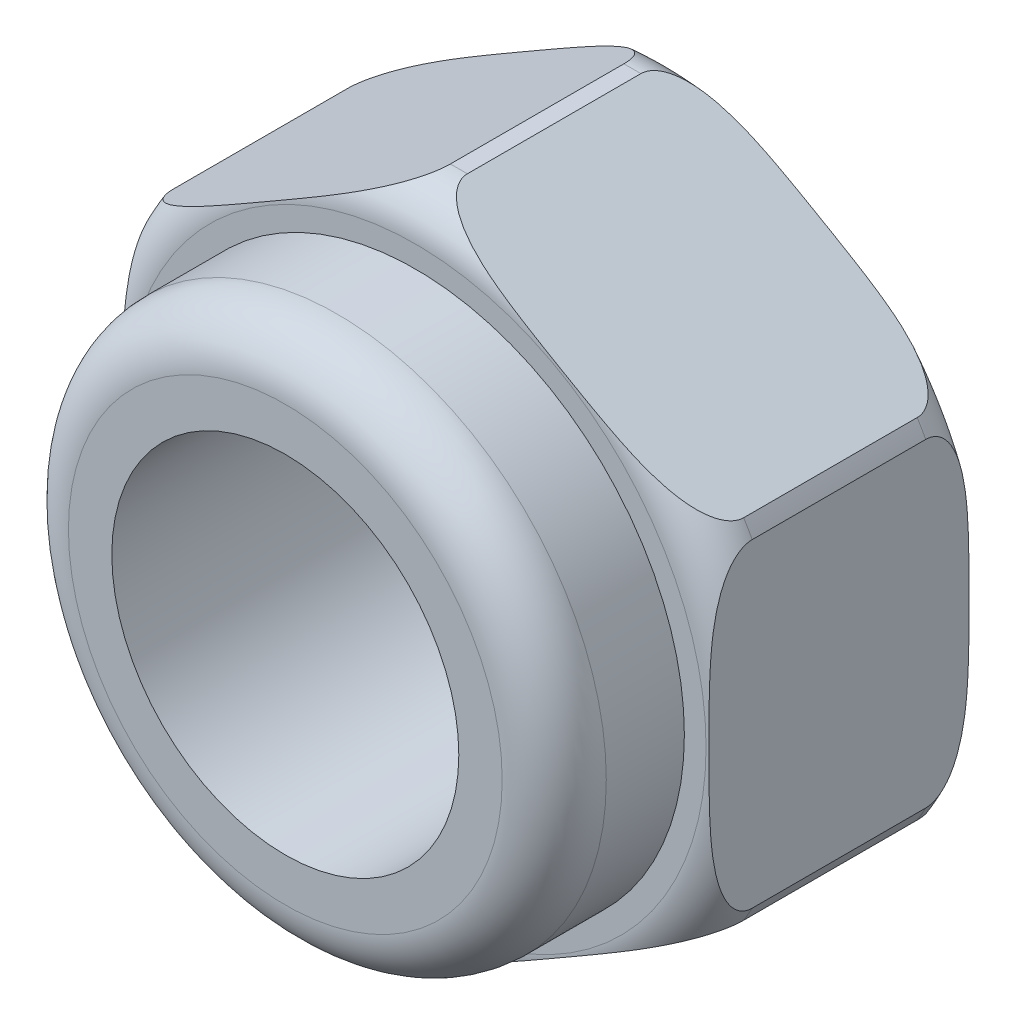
ISO-10303-21;
HEADER;
FILE_DESCRIPTION(('STEP AP214'),'2;1');
FILE_NAME('part.step','',(''),(''),'','','');
FILE_SCHEMA(('AUTOMOTIVE_DESIGN { 1 0 10303 214 1 1 1 1 }'));
ENDSEC;
DATA;
#1=APPLICATION_CONTEXT('core data for automotive mechanical design processes');
#2=APPLICATION_PROTOCOL_DEFINITION('international standard','automotive_design',2000,#1);
#3=PRODUCT_CONTEXT('',#1,'mechanical');
#4=PRODUCT('Part','Part','',(#3));
#5=PRODUCT_RELATED_PRODUCT_CATEGORY('part','',(#4));
#6=PRODUCT_DEFINITION_FORMATION('','',#4);
#7=PRODUCT_DEFINITION_CONTEXT('part definition',#1,'design');
#8=PRODUCT_DEFINITION('design','',#6,#7);
#9=PRODUCT_DEFINITION_SHAPE('','',#8);
#10=(LENGTH_UNIT() NAMED_UNIT(*) SI_UNIT(.MILLI.,.METRE.));
#11=(NAMED_UNIT(*) PLANE_ANGLE_UNIT() SI_UNIT($,.RADIAN.));
#12=(NAMED_UNIT(*) SI_UNIT($,.STERADIAN.) SOLID_ANGLE_UNIT());
#13=UNCERTAINTY_MEASURE_WITH_UNIT(LENGTH_MEASURE(1.E-05),#10,'distance_accuracy_value','');
#14=(GEOMETRIC_REPRESENTATION_CONTEXT(3) GLOBAL_UNCERTAINTY_ASSIGNED_CONTEXT((#13)) GLOBAL_UNIT_ASSIGNED_CONTEXT((#10,
#11,#12)) REPRESENTATION_CONTEXT('',''));
#15=CARTESIAN_POINT('',(0.,0.,0.));
#16=DIRECTION('',(0.,0.,1.));
#17=DIRECTION('',(1.,0.,0.));
#18=AXIS2_PLACEMENT_3D('',#15,#16,#17);
#19=CARTESIAN_POINT('',(0.,0.,3.));
#20=DIRECTION('',(0.,0.,1.));
#21=DIRECTION('',(1.,0.,0.));
#22=AXIS2_PLACEMENT_3D('',#19,#20,#21);
#23=PLANE('',#22);
#24=CARTESIAN_POINT('',(0.,0.,3.));
#25=DIRECTION('',(0.,0.,1.));
#26=DIRECTION('',(1.,0.,0.));
#27=AXIS2_PLACEMENT_3D('',#24,#25,#26);
#28=CIRCLE('',#27,3.35);
#29=CARTESIAN_POINT('',(3.35,0.,3.));
#30=VERTEX_POINT('',#29);
#31=EDGE_CURVE('E138',#30,#30,#28,.T.);
#32=ORIENTED_EDGE('',*,*,#31,.T.);
#33=EDGE_LOOP('',(#32));
#34=FACE_BOUND('',#33,.T.);
#35=CARTESIAN_POINT('',(0.,0.,3.));
#36=DIRECTION('',(0.,0.,1.));
#37=DIRECTION('',(1.,0.,0.));
#38=AXIS2_PLACEMENT_3D('',#35,#36,#37);
#39=CIRCLE('',#38,3.1);
#40=CARTESIAN_POINT('',(3.1,0.,3.));
#41=VERTEX_POINT('',#40);
#42=EDGE_CURVE('E508',#41,#41,#39,.T.);
#43=ORIENTED_EDGE('',*,*,#42,.F.);
#44=EDGE_LOOP('',(#43));
#45=FACE_BOUND('',#44,.T.);
#46=ADVANCED_FACE('F38',(#34,#45),#23,.T.);
#47=CARTESIAN_POINT('',(0.,0.,3.));
#48=DIRECTION('',(0.,0.,-1.));
#49=DIRECTION('',(-1.,0.,0.));
#50=AXIS2_PLACEMENT_3D('',#47,#48,#49);
#51=CYLINDRICAL_SURFACE('',#50,3.85);
#52=DIRECTION('',(0.,0.,-1.));
#53=VECTOR('',#52,1.);
#54=CARTESIAN_POINT('',(-0.0979610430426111,3.84875351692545,3.));
#55=LINE('',#54,#53);
#56=CARTESIAN_POINT('',(-0.0979610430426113,3.84875351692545,2.5));
#57=VERTEX_POINT('',#56);
#58=CARTESIAN_POINT('',(-0.0979610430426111,3.84875351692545,0.5));
#59=VERTEX_POINT('',#58);
#60=EDGE_CURVE('E371',#57,#59,#55,.T.);
#61=ORIENTED_EDGE('',*,*,#60,.F.);
#62=CARTESIAN_POINT('',(0.,0.,2.5));
#63=DIRECTION('',(0.,0.,1.));
#64=DIRECTION('',(1.,0.,0.));
#65=AXIS2_PLACEMENT_3D('',#62,#63,#64);
#66=CIRCLE('',#65,3.85);
#67=CARTESIAN_POINT('',(0.097961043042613,3.84875351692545,2.5));
#68=VERTEX_POINT('',#67);
#69=EDGE_CURVE('E155',#57,#68,#66,.F.);
#70=ORIENTED_EDGE('',*,*,#69,.T.);
#71=DIRECTION('',(0.,0.,-1.));
#72=VECTOR('',#71,1.);
#73=CARTESIAN_POINT('',(0.097961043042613,3.84875351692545,3.));
#74=LINE('',#73,#72);
#75=CARTESIAN_POINT('',(0.097961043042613,3.84875351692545,0.5));
#76=VERTEX_POINT('',#75);
#77=EDGE_CURVE('E61',#76,#68,#74,.F.);
#78=ORIENTED_EDGE('',*,*,#77,.F.);
#79=CARTESIAN_POINT('',(0.,0.,0.5));
#80=DIRECTION('',(0.,0.,1.));
#81=DIRECTION('',(1.,0.,0.));
#82=AXIS2_PLACEMENT_3D('',#79,#80,#81);
#83=CIRCLE('',#82,3.85);
#84=EDGE_CURVE('E176',#76,#59,#83,.T.);
#85=ORIENTED_EDGE('',*,*,#84,.T.);
#86=EDGE_LOOP('',(#61,#70,#78,#85));
#87=FACE_BOUND('',#86,.T.);
#88=ADVANCED_FACE('F292',(#87),#51,.T.);
#89=DIRECTION('',(0.,0.,-1.));
#90=VECTOR('',#89,1.);
#91=CARTESIAN_POINT('',(-3.28413779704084,2.00921351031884,3.));
#92=LINE('',#91,#90);
#93=CARTESIAN_POINT('',(-3.28413779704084,2.00921351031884,0.5));
#94=VERTEX_POINT('',#93);
#95=CARTESIAN_POINT('',(-3.28413779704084,2.00921351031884,2.5));
#96=VERTEX_POINT('',#95);
#97=EDGE_CURVE('E248',#94,#96,#92,.F.);
#98=ORIENTED_EDGE('',*,*,#97,.F.);
#99=CARTESIAN_POINT('',(-3.38209884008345,1.83954000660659,0.5));
#100=VERTEX_POINT('',#99);
#101=EDGE_CURVE('E147',#94,#100,#83,.T.);
#102=ORIENTED_EDGE('',*,*,#101,.T.);
#103=DIRECTION('',(0.,0.,-1.));
#104=VECTOR('',#103,1.);
#105=CARTESIAN_POINT('',(-3.38209884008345,1.83954000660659,3.));
#106=LINE('',#105,#104);
#107=CARTESIAN_POINT('',(-3.38209884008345,1.83954000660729,2.49999999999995));
#108=VERTEX_POINT('',#107);
#109=EDGE_CURVE('E129',#108,#100,#106,.T.);
#110=ORIENTED_EDGE('',*,*,#109,.F.);
#111=EDGE_CURVE('E145',#108,#96,#66,.F.);
#112=ORIENTED_EDGE('',*,*,#111,.T.);
#113=EDGE_LOOP('',(#98,#102,#110,#112));
#114=FACE_BOUND('',#113,.T.);
#115=ADVANCED_FACE('F144',(#114),#51,.T.);
#116=DIRECTION('',(0.,0.,-1.));
#117=VECTOR('',#116,1.);
#118=CARTESIAN_POINT('',(3.28413779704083,2.00921351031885,3.));
#119=LINE('',#118,#117);
#120=CARTESIAN_POINT('',(3.28413779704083,2.00921351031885,2.5));
#121=VERTEX_POINT('',#120);
#122=CARTESIAN_POINT('',(3.28413779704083,2.00921351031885,0.5));
#123=VERTEX_POINT('',#122);
#124=EDGE_CURVE('E249',#121,#123,#119,.T.);
#125=ORIENTED_EDGE('',*,*,#124,.F.);
#126=CARTESIAN_POINT('',(3.38209884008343,1.83954000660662,2.5));
#127=VERTEX_POINT('',#126);
#128=EDGE_CURVE('E159',#121,#127,#66,.F.);
#129=ORIENTED_EDGE('',*,*,#128,.T.);
#130=DIRECTION('',(0.,0.,-1.));
#131=VECTOR('',#130,1.);
#132=CARTESIAN_POINT('',(3.38209884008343,1.83954000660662,3.));
#133=LINE('',#132,#131);
#134=CARTESIAN_POINT('',(3.38209884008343,1.83954000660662,0.5));
#135=VERTEX_POINT('',#134);
#136=EDGE_CURVE('E53',#135,#127,#133,.F.);
#137=ORIENTED_EDGE('',*,*,#136,.F.);
#138=EDGE_CURVE('E172',#135,#123,#83,.T.);
#139=ORIENTED_EDGE('',*,*,#138,.T.);
#140=EDGE_LOOP('',(#125,#129,#137,#139));
#141=FACE_BOUND('',#140,.T.);
#142=ADVANCED_FACE('F360',(#141),#51,.T.);
#143=DIRECTION('',(0.,0.,-1.));
#144=VECTOR('',#143,1.);
#145=CARTESIAN_POINT('',(3.38209884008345,-1.83954000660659,3.));
#146=LINE('',#145,#144);
#147=CARTESIAN_POINT('',(3.38209884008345,-1.83954000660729,2.49999999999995));
#148=VERTEX_POINT('',#147);
#149=CARTESIAN_POINT('',(3.38209884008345,-1.83954000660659,0.5));
#150=VERTEX_POINT('',#149);
#151=EDGE_CURVE('E338',#148,#150,#146,.T.);
#152=ORIENTED_EDGE('',*,*,#151,.F.);
#153=CARTESIAN_POINT('',(3.28413779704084,-2.00921351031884,2.5));
#154=VERTEX_POINT('',#153);
#155=EDGE_CURVE('E160',#148,#154,#66,.F.);
#156=ORIENTED_EDGE('',*,*,#155,.T.);
#157=DIRECTION('',(0.,0.,-1.));
#158=VECTOR('',#157,1.);
#159=CARTESIAN_POINT('',(3.28413779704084,-2.00921351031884,3.));
#160=LINE('',#159,#158);
#161=CARTESIAN_POINT('',(3.28413779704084,-2.00921351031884,0.5));
#162=VERTEX_POINT('',#161);
#163=EDGE_CURVE('E340',#162,#154,#160,.F.);
#164=ORIENTED_EDGE('',*,*,#163,.F.);
#165=EDGE_CURVE('E164',#162,#150,#83,.T.);
#166=ORIENTED_EDGE('',*,*,#165,.T.);
#167=EDGE_LOOP('',(#152,#156,#164,#166));
#168=FACE_BOUND('',#167,.T.);
#169=ADVANCED_FACE('F337',(#168),#51,.T.);
#170=DIRECTION('',(0.,0.,-1.));
#171=VECTOR('',#170,1.);
#172=CARTESIAN_POINT('',(0.0979610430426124,-3.84875351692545,3.));
#173=LINE('',#172,#171);
#174=CARTESIAN_POINT('',(0.0979610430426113,-3.84875351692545,2.5));
#175=VERTEX_POINT('',#174);
#176=CARTESIAN_POINT('',(0.0979610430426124,-3.84875351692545,0.5));
#177=VERTEX_POINT('',#176);
#178=EDGE_CURVE('E344',#175,#177,#173,.T.);
#179=ORIENTED_EDGE('',*,*,#178,.F.);
#180=CARTESIAN_POINT('',(-0.097961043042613,-3.84875351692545,2.5));
#181=VERTEX_POINT('',#180);
#182=EDGE_CURVE('E157',#175,#181,#66,.F.);
#183=ORIENTED_EDGE('',*,*,#182,.T.);
#184=DIRECTION('',(0.,0.,-1.));
#185=VECTOR('',#184,1.);
#186=CARTESIAN_POINT('',(-0.0979610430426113,-3.84875351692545,3.));
#187=LINE('',#186,#185);
#188=CARTESIAN_POINT('',(-0.0979610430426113,-3.84875351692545,0.5));
#189=VERTEX_POINT('',#188);
#190=EDGE_CURVE('E204',#189,#181,#187,.F.);
#191=ORIENTED_EDGE('',*,*,#190,.F.);
#192=EDGE_CURVE('E324',#189,#177,#83,.T.);
#193=ORIENTED_EDGE('',*,*,#192,.T.);
#194=EDGE_LOOP('',(#179,#183,#191,#193));
#195=FACE_BOUND('',#194,.T.);
#196=ADVANCED_FACE('F354',(#195),#51,.T.);
#197=DIRECTION('',(0.,0.,-1.));
#198=VECTOR('',#197,1.);
#199=CARTESIAN_POINT('',(-3.28413779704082,-2.00921351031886,3.));
#200=LINE('',#199,#198);
#201=CARTESIAN_POINT('',(-3.28413779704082,-2.00921351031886,2.5));
#202=VERTEX_POINT('',#201);
#203=CARTESIAN_POINT('',(-3.28413779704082,-2.00921351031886,0.5));
#204=VERTEX_POINT('',#203);
#205=EDGE_CURVE('E348',#202,#204,#200,.T.);
#206=ORIENTED_EDGE('',*,*,#205,.F.);
#207=CARTESIAN_POINT('',(-3.38209884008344,-1.83954000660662,2.5));
#208=VERTEX_POINT('',#207);
#209=EDGE_CURVE('E154',#202,#208,#66,.F.);
#210=ORIENTED_EDGE('',*,*,#209,.T.);
#211=DIRECTION('',(0.,0.,-1.));
#212=VECTOR('',#211,1.);
#213=CARTESIAN_POINT('',(-3.38209884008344,-1.83954000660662,3.));
#214=LINE('',#213,#212);
#215=CARTESIAN_POINT('',(-3.38209884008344,-1.83954000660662,0.5));
#216=VERTEX_POINT('',#215);
#217=EDGE_CURVE('E132',#216,#208,#214,.F.);
#218=ORIENTED_EDGE('',*,*,#217,.F.);
#219=EDGE_CURVE('E322',#216,#204,#83,.T.);
#220=ORIENTED_EDGE('',*,*,#219,.T.);
#221=EDGE_LOOP('',(#206,#210,#218,#220));
#222=FACE_BOUND('',#221,.T.);
#223=ADVANCED_FACE('F211',(#222),#51,.T.);
#224=CARTESIAN_POINT('',(0.,0.,0.5));
#225=DIRECTION('',(0.,0.,1.));
#226=DIRECTION('',(1.,0.,0.));
#227=AXIS2_PLACEMENT_3D('',#224,#225,#226);
#228=TOROIDAL_SURFACE('',#227,3.35,0.5);
#229=CARTESIAN_POINT('',(0.,0.,0.));
#230=DIRECTION('',(0.,0.,1.));
#231=DIRECTION('',(1.,0.,0.));
#232=AXIS2_PLACEMENT_3D('',#229,#230,#231);
#233=CIRCLE('',#232,3.35);
#234=CARTESIAN_POINT('',(3.35,0.,0.));
#235=VERTEX_POINT('',#234);
#236=EDGE_CURVE('E175',#235,#235,#233,.F.);
#237=ORIENTED_EDGE('',*,*,#236,.F.);
#238=EDGE_LOOP('',(#237));
#239=FACE_BOUND('',#238,.T.);
#240=ORIENTED_EDGE('',*,*,#101,.F.);
#241=CARTESIAN_POINT('',(-3.28413772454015,2.00921355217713,0.5002));
#242=CARTESIAN_POINT('',(-3.28417809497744,2.0091902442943,0.485820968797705));
#243=CARTESIAN_POINT('',(-3.28303612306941,2.0098495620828,0.471478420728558));
#244=CARTESIAN_POINT('',(-3.27864871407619,2.01238263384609,0.443353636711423));
#245=CARTESIAN_POINT('',(-3.2754219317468,2.01424561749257,0.429567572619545));
#246=CARTESIAN_POINT('',(-3.26713042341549,2.01903272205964,0.402816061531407));
#247=CARTESIAN_POINT('',(-3.26207114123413,2.02195369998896,0.389848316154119));
#248=CARTESIAN_POINT('',(-3.25043927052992,2.02866936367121,0.364830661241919));
#249=CARTESIAN_POINT('',(-3.24386315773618,2.0324660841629,0.352782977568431));
#250=CARTESIAN_POINT('',(-3.22462585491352,2.04357274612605,0.321820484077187));
#251=CARTESIAN_POINT('',(-3.21086971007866,2.05151486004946,0.303813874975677));
#252=CARTESIAN_POINT('',(-3.18113377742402,2.06868290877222,0.270454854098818));
#253=CARTESIAN_POINT('',(-3.16514790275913,2.07791235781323,0.25510997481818));
#254=CARTESIAN_POINT('',(-3.11897971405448,2.10456757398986,0.215898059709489));
#255=CARTESIAN_POINT('',(-3.0872677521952,2.12287648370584,0.19445572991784));
#256=CARTESIAN_POINT('',(-3.02160789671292,2.16078521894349,0.156918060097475));
#257=CARTESIAN_POINT('',(-2.98765487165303,2.18038800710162,0.140835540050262));
#258=CARTESIAN_POINT('',(-2.90283504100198,2.22935875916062,0.106279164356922));
#259=CARTESIAN_POINT('',(-2.85129663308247,2.25911447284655,0.0900423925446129));
#260=CARTESIAN_POINT('',(-2.74708565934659,2.31928070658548,0.0632898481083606));
#261=CARTESIAN_POINT('',(-2.6944106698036,2.34969262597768,0.0527878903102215));
#262=CARTESIAN_POINT('',(-2.58835829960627,2.41092199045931,0.0357283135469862));
#263=CARTESIAN_POINT('',(-2.53497881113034,2.44174065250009,0.0291889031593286));
#264=CARTESIAN_POINT('',(-2.42801750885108,2.5034947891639,0.0188403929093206));
#265=CARTESIAN_POINT('',(-2.37443562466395,2.53443030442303,0.0150323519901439));
#266=CARTESIAN_POINT('',(-2.2599875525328,2.60050692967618,0.00880240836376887));
#267=CARTESIAN_POINT('',(-2.19911178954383,2.63565356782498,0.00663611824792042));
#268=CARTESIAN_POINT('',(-2.07732600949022,2.7059666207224,0.00357981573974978));
#269=CARTESIAN_POINT('',(-2.01641598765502,2.7411330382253,0.00269012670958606));
#270=CARTESIAN_POINT('',(-1.89479396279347,2.81135154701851,0.00152631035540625));
#271=CARTESIAN_POINT('',(-1.83408197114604,2.84640363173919,0.00125015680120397));
#272=CARTESIAN_POINT('',(-1.71266311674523,2.91650484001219,0.00098807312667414));
#273=CARTESIAN_POINT('',(-1.65195625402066,2.95155396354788,0.0010021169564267));
#274=CARTESIAN_POINT('',(-1.50880434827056,3.03420275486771,0.00137804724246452));
#275=CARTESIAN_POINT('',(-1.42635959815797,3.08180225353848,0.00186269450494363));
#276=CARTESIAN_POINT('',(-1.26147365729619,3.17699919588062,0.00437708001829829));
#277=CARTESIAN_POINT('',(-1.17903246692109,3.224596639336,0.00640689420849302));
#278=CARTESIAN_POINT('',(-1.04063241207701,3.30450194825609,0.0129730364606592));
#279=CARTESIAN_POINT('',(-0.984642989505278,3.33682745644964,0.0164991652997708));
#280=CARTESIAN_POINT('',(-0.872746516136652,3.40143091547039,0.0263425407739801));
#281=CARTESIAN_POINT('',(-0.816839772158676,3.43370868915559,0.0326645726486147));
#282=CARTESIAN_POINT('',(-0.698402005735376,3.5020887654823,0.0505447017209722));
#283=CARTESIAN_POINT('',(-0.635925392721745,3.53815965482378,0.0626629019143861));
#284=CARTESIAN_POINT('',(-0.543527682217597,3.59150549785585,0.087014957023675));
#285=CARTESIAN_POINT('',(-0.512998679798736,3.60913142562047,0.096140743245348));
#286=CARTESIAN_POINT('',(-0.452594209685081,3.64400596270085,0.116996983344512));
#287=CARTESIAN_POINT('',(-0.422718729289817,3.66125457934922,0.128727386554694));
#288=CARTESIAN_POINT('',(-0.371851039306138,3.69062305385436,0.151941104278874));
#289=CARTESIAN_POINT('',(-0.350601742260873,3.70289134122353,0.162667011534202));
#290=CARTESIAN_POINT('',(-0.309019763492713,3.72689870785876,0.186257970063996));
#291=CARTESIAN_POINT('',(-0.288686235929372,3.73863827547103,0.199120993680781));
#292=CARTESIAN_POINT('',(-0.249194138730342,3.76143904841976,0.227571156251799));
#293=CARTESIAN_POINT('',(-0.230049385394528,3.77249227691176,0.243184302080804));
#294=CARTESIAN_POINT('',(-0.193997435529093,3.79330687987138,0.27755627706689));
#295=CARTESIAN_POINT('',(-0.177084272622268,3.80307169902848,0.296306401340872));
#296=CARTESIAN_POINT('',(-0.152895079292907,3.81703733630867,0.329140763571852));
#297=CARTESIAN_POINT('',(-0.144470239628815,3.82190141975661,0.342091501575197));
#298=CARTESIAN_POINT('',(-0.129329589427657,3.83064287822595,0.36927898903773));
#299=CARTESIAN_POINT('',(-0.122612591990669,3.83452093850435,0.38351483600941));
#300=CARTESIAN_POINT('',(-0.112026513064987,3.84063281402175,0.411370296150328));
#301=CARTESIAN_POINT('',(-0.107915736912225,3.84300617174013,0.42486620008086));
#302=CARTESIAN_POINT('',(-0.101721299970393,3.84658253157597,0.452449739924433));
#303=CARTESIAN_POINT('',(-0.0996327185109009,3.84778837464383,0.466535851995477));
#304=CARTESIAN_POINT('',(-0.0981796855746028,3.84862728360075,0.48719605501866));
#305=CARTESIAN_POINT('',(-0.0979520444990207,3.84875871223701,0.493699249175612));
#306=CARTESIAN_POINT('',(-0.0979611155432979,3.84875347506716,0.500199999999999));
#307=B_SPLINE_CURVE_WITH_KNOTS('',3,(#241,#242,#243,#244,#245,#246,#247,#248,#249,#250,#251,
#252,#253,#254,#255,#256,#257,#258,#259,#260,#261,#262,#263,#264,#265,#266,#267,#268,#269,#270,
#271,#272,#273,#274,#275,#276,#277,#278,#279,#280,#281,#282,#283,#284,#285,#286,#287,#288,#289,
#290,#291,#292,#293,#294,#295,#296,#297,#298,#299,#300,#301,#302,#303,#304,#305,#306),
.UNSPECIFIED.,.F.,.F.,(4,2,2,2,2,2,2,2,2,2,2,2,2,2,2,2,2,2,2,2,2,2,2,2,2,2,2,2,2,2,2,2,4),(0.,
0.0430159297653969,0.0856521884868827,0.128162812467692,0.170773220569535,0.242390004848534,
0.314206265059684,0.440788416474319,0.567671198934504,0.752240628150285,0.937252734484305,
1.12310868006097,1.30903664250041,1.51999417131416,1.7310051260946,1.94131816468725,
2.15161232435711,2.43721237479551,2.72282646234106,2.9170243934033,3.11155599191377,
3.33063742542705,3.43980822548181,3.54897690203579,3.62923200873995,3.70941140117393,
3.79039427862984,3.87115605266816,3.91961440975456,3.96803899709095,4.01078127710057,
4.05341928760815,4.07292322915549),.UNSPECIFIED.);
#308=EDGE_CURVE('E165',#94,#59,#307,.T.);
#309=ORIENTED_EDGE('',*,*,#308,.T.);
#310=ORIENTED_EDGE('',*,*,#84,.F.);
#311=CARTESIAN_POINT('',(0.0979611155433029,3.84875347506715,0.5002));
#312=CARTESIAN_POINT('',(0.0979207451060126,3.84877678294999,0.485820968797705));
#313=CARTESIAN_POINT('',(0.0990627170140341,3.84811746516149,0.471478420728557));
#314=CARTESIAN_POINT('',(0.103450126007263,3.8455843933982,0.443353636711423));
#315=CARTESIAN_POINT('',(0.106676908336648,3.84372140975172,0.429567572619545));
#316=CARTESIAN_POINT('',(0.114968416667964,3.83893430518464,0.402816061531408));
#317=CARTESIAN_POINT('',(0.12002769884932,3.83601332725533,0.389848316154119));
#318=CARTESIAN_POINT('',(0.131659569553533,3.82929766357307,0.364830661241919));
#319=CARTESIAN_POINT('',(0.13823568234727,3.82550094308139,0.352782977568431));
#320=CARTESIAN_POINT('',(0.157472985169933,3.81439428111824,0.321820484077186));
#321=CARTESIAN_POINT('',(0.171229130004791,3.80645216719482,0.303813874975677));
#322=CARTESIAN_POINT('',(0.200965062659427,3.78928411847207,0.270454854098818));
#323=CARTESIAN_POINT('',(0.21695093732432,3.78005466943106,0.25510997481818));
#324=CARTESIAN_POINT('',(0.263119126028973,3.75339945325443,0.215898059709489));
#325=CARTESIAN_POINT('',(0.29483108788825,3.73509054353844,0.19445572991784));
#326=CARTESIAN_POINT('',(0.360490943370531,3.6971818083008,0.156918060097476));
#327=CARTESIAN_POINT('',(0.394443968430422,3.67757902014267,0.140835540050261));
#328=CARTESIAN_POINT('',(0.479263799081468,3.62860826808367,0.106279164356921));
#329=CARTESIAN_POINT('',(0.53080220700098,3.59885255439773,0.0900423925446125));
#330=CARTESIAN_POINT('',(0.63501318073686,3.53868632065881,0.0632898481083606));
#331=CARTESIAN_POINT('',(0.687688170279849,3.5082744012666,0.0527878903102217));
#332=CARTESIAN_POINT('',(0.793740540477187,3.44704503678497,0.0357283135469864));
#333=CARTESIAN_POINT('',(0.847120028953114,3.41622637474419,0.0291889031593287));
#334=CARTESIAN_POINT('',(0.954081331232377,3.35447223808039,0.0188403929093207));
#335=CARTESIAN_POINT('',(1.00766321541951,3.32353672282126,0.0150323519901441));
#336=CARTESIAN_POINT('',(1.12211128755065,3.25746009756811,0.00880240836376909));
#337=CARTESIAN_POINT('',(1.18298705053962,3.2223134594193,0.00663611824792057));
#338=CARTESIAN_POINT('',(1.30477283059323,3.15200040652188,0.00357981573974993));
#339=CARTESIAN_POINT('',(1.36568285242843,3.11683398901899,0.00269012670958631));
#340=CARTESIAN_POINT('',(1.48730487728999,3.04661548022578,0.00152631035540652));
#341=CARTESIAN_POINT('',(1.54801686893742,3.0115633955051,0.00125015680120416));
#342=CARTESIAN_POINT('',(1.66943572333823,2.94146218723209,0.000988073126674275));
#343=CARTESIAN_POINT('',(1.7301425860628,2.9064130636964,0.00100211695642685));
#344=CARTESIAN_POINT('',(1.8732944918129,2.82376427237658,0.00137804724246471));
#345=CARTESIAN_POINT('',(1.95573924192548,2.77616477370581,0.00186269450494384));
#346=CARTESIAN_POINT('',(2.12062518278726,2.68096783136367,0.00437708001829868));
#347=CARTESIAN_POINT('',(2.20306637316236,2.63337038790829,0.00640689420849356));
#348=CARTESIAN_POINT('',(2.34146642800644,2.5534650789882,0.0129730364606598));
#349=CARTESIAN_POINT('',(2.39745585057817,2.52113957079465,0.0164991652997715));
#350=CARTESIAN_POINT('',(2.5093523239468,2.4565361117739,0.0263425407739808));
#351=CARTESIAN_POINT('',(2.56525906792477,2.4242583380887,0.0326645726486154));
#352=CARTESIAN_POINT('',(2.68369683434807,2.35587826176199,0.0505447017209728));
#353=CARTESIAN_POINT('',(2.7461734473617,2.31980737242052,0.0626629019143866));
#354=CARTESIAN_POINT('',(2.83857115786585,2.26646152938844,0.0870149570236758));
#355=CARTESIAN_POINT('',(2.86910016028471,2.24883560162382,0.0961407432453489));
#356=CARTESIAN_POINT('',(2.92950463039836,2.21396106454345,0.116996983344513));
#357=CARTESIAN_POINT('',(2.95938011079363,2.19671244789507,0.128727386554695));
#358=CARTESIAN_POINT('',(3.01024780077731,2.16734397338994,0.151941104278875));
#359=CARTESIAN_POINT('',(3.03149709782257,2.15507568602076,0.162667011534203));
#360=CARTESIAN_POINT('',(3.07307907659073,2.13106831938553,0.186257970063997));
#361=CARTESIAN_POINT('',(3.09341260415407,2.11932875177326,0.199120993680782));
#362=CARTESIAN_POINT('',(3.1329047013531,2.09652797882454,0.2275711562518));
#363=CARTESIAN_POINT('',(3.15204945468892,2.08547475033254,0.243184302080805));
#364=CARTESIAN_POINT('',(3.18810140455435,2.06466014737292,0.277556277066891));
#365=CARTESIAN_POINT('',(3.20501456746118,2.05489532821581,0.296306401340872));
#366=CARTESIAN_POINT('',(3.22920376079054,2.04092969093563,0.329140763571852));
#367=CARTESIAN_POINT('',(3.23762860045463,2.03606560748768,0.342091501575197));
#368=CARTESIAN_POINT('',(3.25276925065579,2.02732414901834,0.36927898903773));
#369=CARTESIAN_POINT('',(3.25948624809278,2.02344608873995,0.383514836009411));
#370=CARTESIAN_POINT('',(3.27007232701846,2.01733421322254,0.411370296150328));
#371=CARTESIAN_POINT('',(3.27418310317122,2.01496085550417,0.424866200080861));
#372=CARTESIAN_POINT('',(3.28037754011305,2.01138449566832,0.452449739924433));
#373=CARTESIAN_POINT('',(3.28246612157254,2.01017865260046,0.466535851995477));
#374=CARTESIAN_POINT('',(3.28391915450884,2.00933974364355,0.48719605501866));
#375=CARTESIAN_POINT('',(3.28414679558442,2.00920831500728,0.493699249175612));
#376=CARTESIAN_POINT('',(3.28413772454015,2.00921355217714,0.5002));
#377=B_SPLINE_CURVE_WITH_KNOTS('',3,(#311,#312,#313,#314,#315,#316,#317,#318,#319,#320,#321,
#322,#323,#324,#325,#326,#327,#328,#329,#330,#331,#332,#333,#334,#335,#336,#337,#338,#339,#340,
#341,#342,#343,#344,#345,#346,#347,#348,#349,#350,#351,#352,#353,#354,#355,#356,#357,#358,#359,
#360,#361,#362,#363,#364,#365,#366,#367,#368,#369,#370,#371,#372,#373,#374,#375,#376),
.UNSPECIFIED.,.F.,.F.,(4,2,2,2,2,2,2,2,2,2,2,2,2,2,2,2,2,2,2,2,2,2,2,2,2,2,2,2,2,2,2,2,4),(0.,
0.0430159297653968,0.0856521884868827,0.128162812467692,0.170773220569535,0.242390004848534,
0.314206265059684,0.44078841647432,0.567671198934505,0.752240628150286,0.937252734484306,
1.12310868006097,1.30903664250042,1.51999417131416,1.73100512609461,1.94131816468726,
2.15161232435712,2.43721237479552,2.72282646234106,2.9170243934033,3.11155599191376,
3.33063742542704,3.4398082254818,3.54897690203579,3.62923200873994,3.70941140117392,
3.79039427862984,3.87115605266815,3.91961440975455,3.96803899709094,4.01078127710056,
4.05341928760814,4.07292322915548),.UNSPECIFIED.);
#378=EDGE_CURVE('E240',#76,#123,#377,.T.);
#379=ORIENTED_EDGE('',*,*,#378,.T.);
#380=ORIENTED_EDGE('',*,*,#138,.F.);
#381=CARTESIAN_POINT('',(3.38209884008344,0.,0.00103139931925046));
#382=CARTESIAN_POINT('',(3.38209884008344,-0.0833399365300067,0.00102800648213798));
#383=CARTESIAN_POINT('',(3.38209884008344,-0.166679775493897,0.00120041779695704));
#384=CARTESIAN_POINT('',(3.38209884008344,-0.333380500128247,0.00222149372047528));
#385=CARTESIAN_POINT('',(3.38209884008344,-0.416741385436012,0.00307034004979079));
#386=CARTESIAN_POINT('',(3.38209884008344,-0.583561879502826,0.00646417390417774));
#387=CARTESIAN_POINT('',(3.38209884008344,-0.667021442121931,0.00901177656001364));
#388=CARTESIAN_POINT('',(3.38209884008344,-0.833757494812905,0.0174882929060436));
#389=CARTESIAN_POINT('',(3.38209884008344,-0.917034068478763,0.0234150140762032));
#390=CARTESIAN_POINT('',(3.38209884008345,-1.04181546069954,0.036802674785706));
#391=CARTESIAN_POINT('',(3.38209884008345,-1.08355201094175,0.0420446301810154));
#392=CARTESIAN_POINT('',(3.38209884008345,-1.16672482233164,0.0545002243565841));
#393=CARTESIAN_POINT('',(3.38209884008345,-1.20816117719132,0.0617132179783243));
#394=CARTESIAN_POINT('',(3.38209884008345,-1.29050136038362,0.0786716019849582));
#395=CARTESIAN_POINT('',(3.38209884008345,-1.33140547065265,0.0884155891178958));
#396=CARTESIAN_POINT('',(3.38209884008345,-1.41227360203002,0.111181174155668));
#397=CARTESIAN_POINT('',(3.38209884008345,-1.45223865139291,0.124198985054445));
#398=CARTESIAN_POINT('',(3.38209884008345,-1.5309079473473,0.154673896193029));
#399=CARTESIAN_POINT('',(3.38209884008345,-1.5695967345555,0.172171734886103));
#400=CARTESIAN_POINT('',(3.38209884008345,-1.64373175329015,0.212983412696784));
#401=CARTESIAN_POINT('',(3.38209884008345,-1.6791958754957,0.236262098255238));
#402=CARTESIAN_POINT('',(3.38209884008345,-1.72538889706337,0.275104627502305));
#403=CARTESIAN_POINT('',(3.38209884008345,-1.73873059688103,0.28754598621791));
#404=CARTESIAN_POINT('',(3.38209884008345,-1.76376132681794,0.31403961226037));
#405=CARTESIAN_POINT('',(3.38209884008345,-1.77544912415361,0.328093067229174));
#406=CARTESIAN_POINT('',(3.38209884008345,-1.79666407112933,0.358043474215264));
#407=CARTESIAN_POINT('',(3.38209884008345,-1.8061624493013,0.373961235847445));
#408=CARTESIAN_POINT('',(3.38209884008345,-1.8219654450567,0.407308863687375));
#409=CARTESIAN_POINT('',(3.38209884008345,-1.82827870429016,0.4247344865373));
#410=CARTESIAN_POINT('',(3.38209884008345,-1.83583601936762,0.455896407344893));
#411=CARTESIAN_POINT('',(3.38209884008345,-1.83796991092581,0.469418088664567));
#412=CARTESIAN_POINT('',(3.38209884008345,-1.83990316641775,0.496627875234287));
#413=CARTESIAN_POINT('',(3.38209884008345,-1.83970351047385,0.510315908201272));
#414=CARTESIAN_POINT('',(3.38209884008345,-1.83698830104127,0.537436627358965));
#415=CARTESIAN_POINT('',(3.38209884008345,-1.83447588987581,0.550869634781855));
#416=CARTESIAN_POINT('',(3.38209884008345,-1.82734823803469,0.577162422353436));
#417=CARTESIAN_POINT('',(3.38209884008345,-1.82273156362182,0.590021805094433));
#418=CARTESIAN_POINT('',(3.38209884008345,-1.80977278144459,0.619309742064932));
#419=CARTESIAN_POINT('',(3.38209884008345,-1.80069214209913,0.635410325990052));
#420=CARTESIAN_POINT('',(3.38209884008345,-1.78007115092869,0.66594678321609));
#421=CARTESIAN_POINT('',(3.38209884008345,-1.76852543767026,0.680378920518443));
#422=CARTESIAN_POINT('',(3.38209884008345,-1.73671420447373,0.715205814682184));
#423=CARTESIAN_POINT('',(3.38209884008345,-1.71517913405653,0.734431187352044));
#424=CARTESIAN_POINT('',(3.38209884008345,-1.66951808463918,0.769463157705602));
#425=CARTESIAN_POINT('',(3.38209884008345,-1.6453863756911,0.785261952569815));
#426=CARTESIAN_POINT('',(3.38209884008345,-1.5966681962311,0.813377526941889));
#427=CARTESIAN_POINT('',(3.38209884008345,-1.57215337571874,0.825820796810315));
#428=CARTESIAN_POINT('',(3.38209884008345,-1.52214894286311,0.848594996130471));
#429=CARTESIAN_POINT('',(3.38209884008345,-1.49665839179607,0.858923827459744));
#430=CARTESIAN_POINT('',(3.38209884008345,-1.44498568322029,0.87783697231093));
#431=CARTESIAN_POINT('',(3.38209884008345,-1.41880217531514,0.88641754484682));
#432=CARTESIAN_POINT('',(3.38209884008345,-1.366016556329,0.902090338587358));
#433=CARTESIAN_POINT('',(3.38209884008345,-1.33941469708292,0.909183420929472));
#434=CARTESIAN_POINT('',(3.38209884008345,-1.26375743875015,0.927489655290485));
#435=CARTESIAN_POINT('',(3.38209884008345,-1.21435157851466,0.937250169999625));
#436=CARTESIAN_POINT('',(3.38209884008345,-1.11502481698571,0.953728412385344));
#437=CARTESIAN_POINT('',(3.38209884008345,-1.06510354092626,0.960443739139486));
#438=CARTESIAN_POINT('',(3.38209884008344,-0.964887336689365,0.971641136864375));
#439=CARTESIAN_POINT('',(3.38209884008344,-0.914591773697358,0.976117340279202));
#440=CARTESIAN_POINT('',(3.38209884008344,-0.813878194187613,0.983430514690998));
#441=CARTESIAN_POINT('',(3.38209884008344,-0.763460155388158,0.986267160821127));
#442=CARTESIAN_POINT('',(3.38209884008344,-0.611570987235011,0.993107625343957));
#443=CARTESIAN_POINT('',(3.38209884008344,-0.510028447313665,0.995391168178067));
#444=CARTESIAN_POINT('',(3.38209884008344,-0.307104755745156,0.998161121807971));
#445=CARTESIAN_POINT('',(3.38209884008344,-0.205723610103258,0.998650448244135));
#446=CARTESIAN_POINT('',(3.38209884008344,-0.00462092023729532,0.999071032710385));
#447=CARTESIAN_POINT('',(3.38209884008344,0.0951005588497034,0.999011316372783));
#448=CARTESIAN_POINT('',(3.38209884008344,0.294630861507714,0.99814084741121));
#449=CARTESIAN_POINT('',(3.38209884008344,0.394439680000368,0.997329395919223));
#450=CARTESIAN_POINT('',(3.38209884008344,0.593795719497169,0.993378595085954));
#451=CARTESIAN_POINT('',(3.38209884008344,0.693342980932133,0.990244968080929));
#452=CARTESIAN_POINT('',(3.38209884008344,0.842393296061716,0.98154110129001));
#453=CARTESIAN_POINT('',(3.38209884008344,0.892006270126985,0.97797542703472));
#454=CARTESIAN_POINT('',(3.38209884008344,0.991056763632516,0.968962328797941));
#455=CARTESIAN_POINT('',(3.38209884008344,1.04049432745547,0.963515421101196));
#456=CARTESIAN_POINT('',(3.38209884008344,1.12642773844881,0.951782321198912));
#457=CARTESIAN_POINT('',(3.38209884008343,1.1630000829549,0.946066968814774));
#458=CARTESIAN_POINT('',(3.38209884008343,1.23583695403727,0.932856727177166));
#459=CARTESIAN_POINT('',(3.38209884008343,1.27210139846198,0.925361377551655));
#460=CARTESIAN_POINT('',(3.38209884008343,1.34394709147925,0.908182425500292));
#461=CARTESIAN_POINT('',(3.38209884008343,1.37953075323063,0.898509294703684));
#462=CARTESIAN_POINT('',(3.38209884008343,1.44980826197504,0.876386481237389));
#463=CARTESIAN_POINT('',(3.38209884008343,1.48450226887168,0.863937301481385));
#464=CARTESIAN_POINT('',(3.38209884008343,1.56550356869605,0.830056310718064));
#465=CARTESIAN_POINT('',(3.38209884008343,1.6112044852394,0.807009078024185));
#466=CARTESIAN_POINT('',(3.38209884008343,1.67533023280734,0.765133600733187));
#467=CARTESIAN_POINT('',(3.38209884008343,1.69605967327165,0.749863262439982));
#468=CARTESIAN_POINT('',(3.38209884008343,1.7350359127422,0.716408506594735));
#469=CARTESIAN_POINT('',(3.38209884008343,1.75328865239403,0.698231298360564));
#470=CARTESIAN_POINT('',(3.38209884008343,1.77995325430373,0.665869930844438));
#471=CARTESIAN_POINT('',(3.38209884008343,1.78952612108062,0.652647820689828));
#472=CARTESIAN_POINT('',(3.38209884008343,1.80659624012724,0.624908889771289));
#473=CARTESIAN_POINT('',(3.38209884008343,1.81409463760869,0.610392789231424));
#474=CARTESIAN_POINT('',(3.38209884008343,1.82651464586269,0.580077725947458));
#475=CARTESIAN_POINT('',(3.38209884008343,1.83140581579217,0.564265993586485));
#476=CARTESIAN_POINT('',(3.38209884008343,1.83794664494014,0.531987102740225));
#477=CARTESIAN_POINT('',(3.38209884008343,1.83960077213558,0.515520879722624));
#478=CARTESIAN_POINT('',(3.38209884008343,1.83948427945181,0.484895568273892));
#479=CARTESIAN_POINT('',(3.38209884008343,1.83815671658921,0.470733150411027));
#480=CARTESIAN_POINT('',(3.38209884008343,1.83308722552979,0.442849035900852));
#481=CARTESIAN_POINT('',(3.38209884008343,1.82934410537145,0.429127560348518));
#482=CARTESIAN_POINT('',(3.38209884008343,1.81873552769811,0.399647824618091));
#483=CARTESIAN_POINT('',(3.38209884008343,1.81137908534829,0.384067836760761));
#484=CARTESIAN_POINT('',(3.38209884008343,1.79423807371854,0.354312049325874));
#485=CARTESIAN_POINT('',(3.38209884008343,1.78444926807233,0.340138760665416));
#486=CARTESIAN_POINT('',(3.38209884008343,1.75776650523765,0.306598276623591));
#487=CARTESIAN_POINT('',(3.38209884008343,1.73975293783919,0.288129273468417));
#488=CARTESIAN_POINT('',(3.38209884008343,1.70115944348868,0.254133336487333));
#489=CARTESIAN_POINT('',(3.38209884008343,1.68057399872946,0.238612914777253));
#490=CARTESIAN_POINT('',(3.38209884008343,1.63964929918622,0.211338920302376));
#491=CARTESIAN_POINT('',(3.38209884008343,1.61944831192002,0.199373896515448));
#492=CARTESIAN_POINT('',(3.38209884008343,1.57809107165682,0.177205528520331));
#493=CARTESIAN_POINT('',(3.38209884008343,1.55693397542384,0.16700377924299));
#494=CARTESIAN_POINT('',(3.38209884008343,1.51391771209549,0.148085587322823));
#495=CARTESIAN_POINT('',(3.38209884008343,1.49205709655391,0.139372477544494));
#496=CARTESIAN_POINT('',(3.38209884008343,1.44788158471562,0.123243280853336));
#497=CARTESIAN_POINT('',(3.38209884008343,1.42556693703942,0.115826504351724));
#498=CARTESIAN_POINT('',(3.38209884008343,1.35963211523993,0.0956903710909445));
#499=CARTESIAN_POINT('',(3.38209884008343,1.31555202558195,0.0844771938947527));
#500=CARTESIAN_POINT('',(3.38209884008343,1.22670758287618,0.065140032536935));
#501=CARTESIAN_POINT('',(3.38209884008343,1.18194260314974,0.057019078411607));
#502=CARTESIAN_POINT('',(3.38209884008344,1.09191863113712,0.0431129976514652));
#503=CARTESIAN_POINT('',(3.38209884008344,1.04665854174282,0.0373351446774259));
#504=CARTESIAN_POINT('',(3.38209884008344,0.955940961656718,0.0275767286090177));
#505=CARTESIAN_POINT('',(3.38209884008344,0.910483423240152,0.023596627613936));
#506=CARTESIAN_POINT('',(3.38209884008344,0.773466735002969,0.0136105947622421));
#507=CARTESIAN_POINT('',(3.38209884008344,0.681766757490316,0.0096253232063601));
#508=CARTESIAN_POINT('',(3.38209884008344,0.498465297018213,0.00431472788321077));
#509=CARTESIAN_POINT('',(3.38209884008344,0.406863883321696,0.00298526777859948));
#510=CARTESIAN_POINT('',(3.38209884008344,0.262653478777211,0.00173540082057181));
#511=CARTESIAN_POINT('',(3.38209884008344,0.210047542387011,0.0014560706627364));
#512=CARTESIAN_POINT('',(3.38209884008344,0.1049610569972,0.00110538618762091));
#513=CARTESIAN_POINT('',(3.38209884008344,0.0524805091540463,0.00103353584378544));
#514=CARTESIAN_POINT('',(3.38209884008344,0.,0.00103139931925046));
#515=B_SPLINE_CURVE_WITH_KNOTS('',3,(#381,#382,#383,#384,#385,#386,#387,#388,#389,#390,#391,
#392,#393,#394,#395,#396,#397,#398,#399,#400,#401,#402,#403,#404,#405,#406,#407,#408,#409,#410,
#411,#412,#413,#414,#415,#416,#417,#418,#419,#420,#421,#422,#423,#424,#425,#426,#427,#428,#429,
#430,#431,#432,#433,#434,#435,#436,#437,#438,#439,#440,#441,#442,#443,#444,#445,#446,#447,#448,
#449,#450,#451,#452,#453,#454,#455,#456,#457,#458,#459,#460,#461,#462,#463,#464,#465,#466,#467,
#468,#469,#470,#471,#472,#473,#474,#475,#476,#477,#478,#479,#480,#481,#482,#483,#484,#485,#486,
#487,#488,#489,#490,#491,#492,#493,#494,#495,#496,#497,#498,#499,#500,#501,#502,#503,#504,#505,
#506,#507,#508,#509,#510,#511,#512,#513,#514),.UNSPECIFIED.,.T.,.F.,(4,2,2,2,2,2,2,2,2,2,2,2,2,
2,2,2,2,2,2,2,2,2,2,2,2,2,2,2,2,2,2,2,2,2,2,2,2,2,2,2,2,2,2,2,2,2,2,2,2,2,2,2,2,2,2,2,2,2,2,2,2,
2,2,2,2,2,4),(0.,0.250019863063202,0.500106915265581,0.750579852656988,1.00089045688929,
1.1270489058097,1.25316611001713,1.37921354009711,1.50511582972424,1.63220638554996,
1.75854225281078,1.81315813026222,1.86781450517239,1.92315268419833,1.97833990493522,
2.01922099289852,2.06008491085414,2.10089338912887,2.14172971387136,2.19687306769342,
2.25213760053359,2.33825541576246,2.42456732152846,2.50691959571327,2.58935319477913,
2.6719613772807,2.75452160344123,2.90545415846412,3.05650550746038,3.2079506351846,
3.35942576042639,3.66407178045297,3.96822252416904,4.26738243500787,4.56682074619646,
4.86552362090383,5.01472214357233,5.16387975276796,5.27489354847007,5.38593608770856,
5.49645568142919,5.60695526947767,5.75951656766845,5.83656693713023,5.91342909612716,
5.96225436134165,6.01105261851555,6.06040879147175,6.1096967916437,6.15215076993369,
6.19462571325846,6.24603041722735,6.29752528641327,6.37448892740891,6.45162061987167,
6.52195289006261,6.59234844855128,6.66289960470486,6.73341311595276,6.86969313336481,
7.00610634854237,7.14293984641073,7.27980849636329,7.55506568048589,7.82989382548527,
7.9877130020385,8.14515456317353),.UNSPECIFIED.);
#516=EDGE_CURVE('E233',#135,#150,#515,.T.);
#517=ORIENTED_EDGE('',*,*,#516,.T.);
#518=ORIENTED_EDGE('',*,*,#165,.F.);
#519=CARTESIAN_POINT('',(3.28413772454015,-2.00921355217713,0.5002));
#520=CARTESIAN_POINT('',(3.28417809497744,-2.00919024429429,0.485820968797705));
#521=CARTESIAN_POINT('',(3.28303612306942,-2.0098495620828,0.471478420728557));
#522=CARTESIAN_POINT('',(3.27864871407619,-2.01238263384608,0.443353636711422));
#523=CARTESIAN_POINT('',(3.2754219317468,-2.01424561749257,0.429567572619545));
#524=CARTESIAN_POINT('',(3.26713042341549,-2.01903272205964,0.402816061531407));
#525=CARTESIAN_POINT('',(3.26207114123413,-2.02195369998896,0.389848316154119));
#526=CARTESIAN_POINT('',(3.25043927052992,-2.02866936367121,0.364830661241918));
#527=CARTESIAN_POINT('',(3.24386315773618,-2.0324660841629,0.35278297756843));
#528=CARTESIAN_POINT('',(3.22462585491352,-2.04357274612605,0.321820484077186));
#529=CARTESIAN_POINT('',(3.21086971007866,-2.05151486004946,0.303813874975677));
#530=CARTESIAN_POINT('',(3.18113377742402,-2.06868290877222,0.270454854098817));
#531=CARTESIAN_POINT('',(3.16514790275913,-2.07791235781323,0.255109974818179));
#532=CARTESIAN_POINT('',(3.11897971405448,-2.10456757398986,0.215898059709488));
#533=CARTESIAN_POINT('',(3.0872677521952,-2.12287648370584,0.194455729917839));
#534=CARTESIAN_POINT('',(3.02160789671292,-2.16078521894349,0.156918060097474));
#535=CARTESIAN_POINT('',(2.98765487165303,-2.18038800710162,0.140835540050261));
#536=CARTESIAN_POINT('',(2.90283504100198,-2.22935875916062,0.106279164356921));
#537=CARTESIAN_POINT('',(2.85129663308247,-2.25911447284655,0.090042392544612));
#538=CARTESIAN_POINT('',(2.74708565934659,-2.31928070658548,0.0632898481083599));
#539=CARTESIAN_POINT('',(2.6944106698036,-2.34969262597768,0.0527878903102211));
#540=CARTESIAN_POINT('',(2.58835829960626,-2.41092199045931,0.0357283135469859));
#541=CARTESIAN_POINT('',(2.53497881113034,-2.44174065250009,0.0291889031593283));
#542=CARTESIAN_POINT('',(2.42801750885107,-2.5034947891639,0.0188403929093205));
#543=CARTESIAN_POINT('',(2.37443562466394,-2.53443030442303,0.0150323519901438));
#544=CARTESIAN_POINT('',(2.2599875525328,-2.60050692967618,0.0088024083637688));
#545=CARTESIAN_POINT('',(2.19911178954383,-2.63565356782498,0.00663611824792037));
#546=CARTESIAN_POINT('',(2.07732600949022,-2.7059666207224,0.00357981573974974));
#547=CARTESIAN_POINT('',(2.01641598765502,-2.7411330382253,0.00269012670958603));
#548=CARTESIAN_POINT('',(1.89479396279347,-2.81135154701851,0.00152631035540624));
#549=CARTESIAN_POINT('',(1.83408197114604,-2.84640363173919,0.00125015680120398));
#550=CARTESIAN_POINT('',(1.71266311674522,-2.91650484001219,0.000988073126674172));
#551=CARTESIAN_POINT('',(1.65195625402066,-2.95155396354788,0.00100211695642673));
#552=CARTESIAN_POINT('',(1.50880434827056,-3.03420275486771,0.00137804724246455));
#553=CARTESIAN_POINT('',(1.42635959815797,-3.08180225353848,0.00186269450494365));
#554=CARTESIAN_POINT('',(1.26147365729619,-3.17699919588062,0.00437708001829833));
#555=CARTESIAN_POINT('',(1.17903246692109,-3.224596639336,0.00640689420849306));
#556=CARTESIAN_POINT('',(1.040632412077,-3.30450194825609,0.0129730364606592));
#557=CARTESIAN_POINT('',(0.984642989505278,-3.33682745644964,0.0164991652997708));
#558=CARTESIAN_POINT('',(0.872746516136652,-3.40143091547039,0.0263425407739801));
#559=CARTESIAN_POINT('',(0.816839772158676,-3.43370868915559,0.0326645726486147));
#560=CARTESIAN_POINT('',(0.698402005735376,-3.5020887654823,0.0505447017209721));
#561=CARTESIAN_POINT('',(0.635925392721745,-3.53815965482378,0.062662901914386));
#562=CARTESIAN_POINT('',(0.543527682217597,-3.59150549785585,0.0870149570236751));
#563=CARTESIAN_POINT('',(0.512998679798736,-3.60913142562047,0.0961407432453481));
#564=CARTESIAN_POINT('',(0.452594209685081,-3.64400596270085,0.116996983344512));
#565=CARTESIAN_POINT('',(0.422718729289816,-3.66125457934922,0.128727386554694));
#566=CARTESIAN_POINT('',(0.371851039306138,-3.69062305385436,0.151941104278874));
#567=CARTESIAN_POINT('',(0.350601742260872,-3.70289134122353,0.162667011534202));
#568=CARTESIAN_POINT('',(0.309019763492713,-3.72689870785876,0.186257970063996));
#569=CARTESIAN_POINT('',(0.288686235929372,-3.73863827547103,0.199120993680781));
#570=CARTESIAN_POINT('',(0.249194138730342,-3.76143904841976,0.227571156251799));
#571=CARTESIAN_POINT('',(0.230049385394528,-3.77249227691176,0.243184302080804));
#572=CARTESIAN_POINT('',(0.193997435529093,-3.79330687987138,0.277556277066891));
#573=CARTESIAN_POINT('',(0.177084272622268,-3.80307169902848,0.296306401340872));
#574=CARTESIAN_POINT('',(0.152895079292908,-3.81703733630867,0.329140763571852));
#575=CARTESIAN_POINT('',(0.144470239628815,-3.82190141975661,0.342091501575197));
#576=CARTESIAN_POINT('',(0.129329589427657,-3.83064287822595,0.36927898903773));
#577=CARTESIAN_POINT('',(0.122612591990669,-3.83452093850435,0.38351483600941));
#578=CARTESIAN_POINT('',(0.112026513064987,-3.84063281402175,0.411370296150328));
#579=CARTESIAN_POINT('',(0.107915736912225,-3.84300617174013,0.42486620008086));
#580=CARTESIAN_POINT('',(0.101721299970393,-3.84658253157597,0.452449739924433));
#581=CARTESIAN_POINT('',(0.0996327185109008,-3.84778837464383,0.466535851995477));
#582=CARTESIAN_POINT('',(0.0981796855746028,-3.84862728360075,0.48719605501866));
#583=CARTESIAN_POINT('',(0.0979520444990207,-3.84875871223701,0.493699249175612));
#584=CARTESIAN_POINT('',(0.0979611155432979,-3.84875347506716,0.500199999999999));
#585=B_SPLINE_CURVE_WITH_KNOTS('',3,(#519,#520,#521,#522,#523,#524,#525,#526,#527,#528,#529,
#530,#531,#532,#533,#534,#535,#536,#537,#538,#539,#540,#541,#542,#543,#544,#545,#546,#547,#548,
#549,#550,#551,#552,#553,#554,#555,#556,#557,#558,#559,#560,#561,#562,#563,#564,#565,#566,#567,
#568,#569,#570,#571,#572,#573,#574,#575,#576,#577,#578,#579,#580,#581,#582,#583,#584),
.UNSPECIFIED.,.F.,.F.,(4,2,2,2,2,2,2,2,2,2,2,2,2,2,2,2,2,2,2,2,2,2,2,2,2,2,2,2,2,2,2,2,4),(0.,
0.0430159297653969,0.0856521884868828,0.128162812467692,0.170773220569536,0.242390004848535,
0.314206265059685,0.440788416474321,0.567671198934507,0.752240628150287,0.937252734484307,
1.12310868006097,1.30903664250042,1.51999417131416,1.7310051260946,1.94131816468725,
2.15161232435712,2.43721237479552,2.72282646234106,2.9170243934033,3.11155599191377,
3.33063742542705,3.43980822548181,3.5489769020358,3.62923200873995,3.70941140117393,
3.79039427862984,3.87115605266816,3.91961440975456,3.96803899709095,4.01078127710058,
4.05341928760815,4.07292322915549),.UNSPECIFIED.);
#586=EDGE_CURVE('E226',#162,#177,#585,.T.);
#587=ORIENTED_EDGE('',*,*,#586,.T.);
#588=ORIENTED_EDGE('',*,*,#192,.F.);
#589=CARTESIAN_POINT('',(-0.0979611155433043,-3.84875347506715,0.5002));
#590=CARTESIAN_POINT('',(-0.0979207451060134,-3.84877678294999,0.485820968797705));
#591=CARTESIAN_POINT('',(-0.0990627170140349,-3.84811746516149,0.471478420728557));
#592=CARTESIAN_POINT('',(-0.103450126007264,-3.8455843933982,0.443353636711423));
#593=CARTESIAN_POINT('',(-0.106676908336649,-3.84372140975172,0.429567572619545));
#594=CARTESIAN_POINT('',(-0.114968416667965,-3.83893430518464,0.402816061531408));
#595=CARTESIAN_POINT('',(-0.120027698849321,-3.83601332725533,0.389848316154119));
#596=CARTESIAN_POINT('',(-0.131659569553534,-3.82929766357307,0.364830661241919));
#597=CARTESIAN_POINT('',(-0.138235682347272,-3.82550094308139,0.352782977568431));
#598=CARTESIAN_POINT('',(-0.157472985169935,-3.81439428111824,0.321820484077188));
#599=CARTESIAN_POINT('',(-0.171229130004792,-3.80645216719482,0.303813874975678));
#600=CARTESIAN_POINT('',(-0.200965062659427,-3.78928411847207,0.270454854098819));
#601=CARTESIAN_POINT('',(-0.216950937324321,-3.78005466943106,0.255109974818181));
#602=CARTESIAN_POINT('',(-0.263119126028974,-3.75339945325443,0.215898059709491));
#603=CARTESIAN_POINT('',(-0.294831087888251,-3.73509054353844,0.194455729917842));
#604=CARTESIAN_POINT('',(-0.360490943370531,-3.6971818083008,0.156918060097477));
#605=CARTESIAN_POINT('',(-0.394443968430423,-3.67757902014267,0.140835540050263));
#606=CARTESIAN_POINT('',(-0.479263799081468,-3.62860826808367,0.106279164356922));
#607=CARTESIAN_POINT('',(-0.530802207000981,-3.59885255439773,0.0900423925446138));
#608=CARTESIAN_POINT('',(-0.635013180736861,-3.53868632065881,0.0632898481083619));
#609=CARTESIAN_POINT('',(-0.687688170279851,-3.50827440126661,0.0527878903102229));
#610=CARTESIAN_POINT('',(-0.793740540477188,-3.44704503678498,0.0357283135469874));
#611=CARTESIAN_POINT('',(-0.847120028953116,-3.41622637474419,0.0291889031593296));
#612=CARTESIAN_POINT('',(-0.954081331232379,-3.35447223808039,0.0188403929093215));
#613=CARTESIAN_POINT('',(-1.00766321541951,-3.32353672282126,0.0150323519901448));
#614=CARTESIAN_POINT('',(-1.12211128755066,-3.25746009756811,0.0088024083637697));
#615=CARTESIAN_POINT('',(-1.18298705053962,-3.22231345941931,0.00663611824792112));
#616=CARTESIAN_POINT('',(-1.30477283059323,-3.15200040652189,0.00357981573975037));
#617=CARTESIAN_POINT('',(-1.36568285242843,-3.11683398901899,0.00269012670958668));
#618=CARTESIAN_POINT('',(-1.48730487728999,-3.04661548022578,0.0015263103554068));
#619=CARTESIAN_POINT('',(-1.54801686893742,-3.0115633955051,0.00125015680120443));
#620=CARTESIAN_POINT('',(-1.66943572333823,-2.9414621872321,0.000988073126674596));
#621=CARTESIAN_POINT('',(-1.73014258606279,-2.90641306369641,0.00100211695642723));
#622=CARTESIAN_POINT('',(-1.87329449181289,-2.82376427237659,0.00137804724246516));
#623=CARTESIAN_POINT('',(-1.95573924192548,-2.77616477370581,0.00186269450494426));
#624=CARTESIAN_POINT('',(-2.12062518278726,-2.68096783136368,0.00437708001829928));
#625=CARTESIAN_POINT('',(-2.20306637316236,-2.6333703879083,0.00640689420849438));
#626=CARTESIAN_POINT('',(-2.34146642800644,-2.55346507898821,0.0129730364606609));
#627=CARTESIAN_POINT('',(-2.39745585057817,-2.52113957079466,0.0164991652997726));
#628=CARTESIAN_POINT('',(-2.50935232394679,-2.45653611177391,0.0263425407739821));
#629=CARTESIAN_POINT('',(-2.56525906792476,-2.42425833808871,0.0326645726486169));
#630=CARTESIAN_POINT('',(-2.68369683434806,-2.355878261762,0.0505447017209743));
#631=CARTESIAN_POINT('',(-2.74617344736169,-2.31980737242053,0.062662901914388));
#632=CARTESIAN_POINT('',(-2.83857115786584,-2.26646152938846,0.0870149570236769));
#633=CARTESIAN_POINT('',(-2.8691001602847,-2.24883560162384,0.09614074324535));
#634=CARTESIAN_POINT('',(-2.92950463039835,-2.21396106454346,0.116996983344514));
#635=CARTESIAN_POINT('',(-2.95938011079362,-2.19671244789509,0.128727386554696));
#636=CARTESIAN_POINT('',(-3.0102478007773,-2.16734397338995,0.151941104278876));
#637=CARTESIAN_POINT('',(-3.03149709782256,-2.15507568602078,0.162667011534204));
#638=CARTESIAN_POINT('',(-3.07307907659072,-2.13106831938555,0.186257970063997));
#639=CARTESIAN_POINT('',(-3.09341260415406,-2.11932875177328,0.199120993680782));
#640=CARTESIAN_POINT('',(-3.13290470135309,-2.09652797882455,0.2275711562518));
#641=CARTESIAN_POINT('',(-3.15204945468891,-2.08547475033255,0.243184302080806));
#642=CARTESIAN_POINT('',(-3.18810140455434,-2.06466014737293,0.277556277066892));
#643=CARTESIAN_POINT('',(-3.20501456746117,-2.05489532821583,0.296306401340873));
#644=CARTESIAN_POINT('',(-3.22920376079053,-2.04092969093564,0.329140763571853));
#645=CARTESIAN_POINT('',(-3.23762860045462,-2.0360656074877,0.342091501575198));
#646=CARTESIAN_POINT('',(-3.25276925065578,-2.02732414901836,0.369278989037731));
#647=CARTESIAN_POINT('',(-3.25948624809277,-2.02344608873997,0.383514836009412));
#648=CARTESIAN_POINT('',(-3.27007232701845,-2.01733421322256,0.411370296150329));
#649=CARTESIAN_POINT('',(-3.27418310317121,-2.01496085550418,0.424866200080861));
#650=CARTESIAN_POINT('',(-3.28037754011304,-2.01138449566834,0.452449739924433));
#651=CARTESIAN_POINT('',(-3.28246612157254,-2.01017865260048,0.466535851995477));
#652=CARTESIAN_POINT('',(-3.28391915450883,-2.00933974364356,0.48719605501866));
#653=CARTESIAN_POINT('',(-3.28414679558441,-2.0092083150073,0.493699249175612));
#654=CARTESIAN_POINT('',(-3.28413772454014,-2.00921355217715,0.5002));
#655=B_SPLINE_CURVE_WITH_KNOTS('',3,(#589,#590,#591,#592,#593,#594,#595,#596,#597,#598,#599,
#600,#601,#602,#603,#604,#605,#606,#607,#608,#609,#610,#611,#612,#613,#614,#615,#616,#617,#618,
#619,#620,#621,#622,#623,#624,#625,#626,#627,#628,#629,#630,#631,#632,#633,#634,#635,#636,#637,
#638,#639,#640,#641,#642,#643,#644,#645,#646,#647,#648,#649,#650,#651,#652,#653,#654),
.UNSPECIFIED.,.F.,.F.,(4,2,2,2,2,2,2,2,2,2,2,2,2,2,2,2,2,2,2,2,2,2,2,2,2,2,2,2,2,2,2,2,4),(0.,
0.0430159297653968,0.0856521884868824,0.128162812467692,0.170773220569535,0.242390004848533,
0.314206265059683,0.440788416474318,0.567671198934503,0.752240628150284,0.937252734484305,
1.12310868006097,1.30903664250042,1.51999417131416,1.7310051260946,1.94131816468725,
2.15161232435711,2.43721237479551,2.72282646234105,2.91702439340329,3.11155599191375,
3.33063742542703,3.43980822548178,3.54897690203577,3.62923200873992,3.7094114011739,
3.79039427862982,3.87115605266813,3.91961440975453,3.96803899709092,4.01078127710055,
4.05341928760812,4.07292322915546),.UNSPECIFIED.);
#656=EDGE_CURVE('E219',#189,#204,#655,.T.);
#657=ORIENTED_EDGE('',*,*,#656,.T.);
#658=ORIENTED_EDGE('',*,*,#219,.F.);
#659=CARTESIAN_POINT('',(-3.38209884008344,0.,0.00103139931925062));
#660=CARTESIAN_POINT('',(-3.38209884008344,0.0833399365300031,0.00102800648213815));
#661=CARTESIAN_POINT('',(-3.38209884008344,0.166679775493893,0.00120041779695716));
#662=CARTESIAN_POINT('',(-3.38209884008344,0.333380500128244,0.00222149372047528));
#663=CARTESIAN_POINT('',(-3.38209884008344,0.416741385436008,0.00307034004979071));
#664=CARTESIAN_POINT('',(-3.38209884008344,0.583561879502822,0.00646417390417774));
#665=CARTESIAN_POINT('',(-3.38209884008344,0.667021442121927,0.0090117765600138));
#666=CARTESIAN_POINT('',(-3.38209884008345,0.833757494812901,0.0174882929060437));
#667=CARTESIAN_POINT('',(-3.38209884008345,0.917034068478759,0.0234150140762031));
#668=CARTESIAN_POINT('',(-3.38209884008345,1.04181546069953,0.0368026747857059));
#669=CARTESIAN_POINT('',(-3.38209884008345,1.08355201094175,0.0420446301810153));
#670=CARTESIAN_POINT('',(-3.38209884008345,1.16672482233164,0.0545002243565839));
#671=CARTESIAN_POINT('',(-3.38209884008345,1.20816117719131,0.0617132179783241));
#672=CARTESIAN_POINT('',(-3.38209884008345,1.29050136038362,0.0786716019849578));
#673=CARTESIAN_POINT('',(-3.38209884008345,1.33140547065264,0.0884155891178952));
#674=CARTESIAN_POINT('',(-3.38209884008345,1.41227360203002,0.111181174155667));
#675=CARTESIAN_POINT('',(-3.38209884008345,1.45223865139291,0.124198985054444));
#676=CARTESIAN_POINT('',(-3.38209884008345,1.53090794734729,0.154673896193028));
#677=CARTESIAN_POINT('',(-3.38209884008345,1.56959673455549,0.172171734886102));
#678=CARTESIAN_POINT('',(-3.38209884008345,1.64373175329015,0.212983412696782));
#679=CARTESIAN_POINT('',(-3.38209884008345,1.6791958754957,0.236262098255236));
#680=CARTESIAN_POINT('',(-3.38209884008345,1.72538889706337,0.275104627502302));
#681=CARTESIAN_POINT('',(-3.38209884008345,1.73873059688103,0.287545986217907));
#682=CARTESIAN_POINT('',(-3.38209884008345,1.76376132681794,0.314039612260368));
#683=CARTESIAN_POINT('',(-3.38209884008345,1.77544912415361,0.328093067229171));
#684=CARTESIAN_POINT('',(-3.38209884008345,1.79666407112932,0.358043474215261));
#685=CARTESIAN_POINT('',(-3.38209884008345,1.8061624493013,0.373961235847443));
#686=CARTESIAN_POINT('',(-3.38209884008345,1.8219654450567,0.407308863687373));
#687=CARTESIAN_POINT('',(-3.38209884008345,1.82827870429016,0.424734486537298));
#688=CARTESIAN_POINT('',(-3.38209884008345,1.83583601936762,0.455896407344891));
#689=CARTESIAN_POINT('',(-3.38209884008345,1.83796991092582,0.469418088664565));
#690=CARTESIAN_POINT('',(-3.38209884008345,1.83990316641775,0.496627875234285));
#691=CARTESIAN_POINT('',(-3.38209884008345,1.83970351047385,0.51031590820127));
#692=CARTESIAN_POINT('',(-3.38209884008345,1.83698830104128,0.537436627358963));
#693=CARTESIAN_POINT('',(-3.38209884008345,1.83447588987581,0.550869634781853));
#694=CARTESIAN_POINT('',(-3.38209884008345,1.82734823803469,0.577162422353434));
#695=CARTESIAN_POINT('',(-3.38209884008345,1.82273156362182,0.590021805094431));
#696=CARTESIAN_POINT('',(-3.38209884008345,1.80977278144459,0.619309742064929));
#697=CARTESIAN_POINT('',(-3.38209884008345,1.80069214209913,0.63541032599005));
#698=CARTESIAN_POINT('',(-3.38209884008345,1.78007115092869,0.665946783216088));
#699=CARTESIAN_POINT('',(-3.38209884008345,1.76852543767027,0.680378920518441));
#700=CARTESIAN_POINT('',(-3.38209884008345,1.73671420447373,0.715205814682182));
#701=CARTESIAN_POINT('',(-3.38209884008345,1.71517913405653,0.734431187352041));
#702=CARTESIAN_POINT('',(-3.38209884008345,1.66951808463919,0.769463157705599));
#703=CARTESIAN_POINT('',(-3.38209884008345,1.64538637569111,0.785261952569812));
#704=CARTESIAN_POINT('',(-3.38209884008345,1.59666819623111,0.813377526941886));
#705=CARTESIAN_POINT('',(-3.38209884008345,1.57215337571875,0.825820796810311));
#706=CARTESIAN_POINT('',(-3.38209884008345,1.52214894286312,0.848594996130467));
#707=CARTESIAN_POINT('',(-3.38209884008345,1.49665839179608,0.85892382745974));
#708=CARTESIAN_POINT('',(-3.38209884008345,1.4449856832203,0.877836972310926));
#709=CARTESIAN_POINT('',(-3.38209884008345,1.41880217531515,0.886417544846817));
#710=CARTESIAN_POINT('',(-3.38209884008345,1.36601655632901,0.902090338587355));
#711=CARTESIAN_POINT('',(-3.38209884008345,1.33941469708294,0.909183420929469));
#712=CARTESIAN_POINT('',(-3.38209884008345,1.26375743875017,0.927489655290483));
#713=CARTESIAN_POINT('',(-3.38209884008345,1.21435157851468,0.937250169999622));
#714=CARTESIAN_POINT('',(-3.38209884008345,1.11502481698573,0.953728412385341));
#715=CARTESIAN_POINT('',(-3.38209884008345,1.06510354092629,0.960443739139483));
#716=CARTESIAN_POINT('',(-3.38209884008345,0.964887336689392,0.971641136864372));
#717=CARTESIAN_POINT('',(-3.38209884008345,0.914591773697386,0.9761173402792));
#718=CARTESIAN_POINT('',(-3.38209884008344,0.813878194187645,0.983430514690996));
#719=CARTESIAN_POINT('',(-3.38209884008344,0.763460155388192,0.986267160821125));
#720=CARTESIAN_POINT('',(-3.38209884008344,0.611570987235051,0.993107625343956));
#721=CARTESIAN_POINT('',(-3.38209884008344,0.510028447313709,0.995391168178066));
#722=CARTESIAN_POINT('',(-3.38209884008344,0.307104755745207,0.998161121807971));
#723=CARTESIAN_POINT('',(-3.38209884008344,0.205723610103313,0.998650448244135));
#724=CARTESIAN_POINT('',(-3.38209884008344,0.00462092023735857,0.999071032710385));
#725=CARTESIAN_POINT('',(-3.38209884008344,-0.0951005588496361,0.999011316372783));
#726=CARTESIAN_POINT('',(-3.38209884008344,-0.294630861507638,0.99814084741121));
#727=CARTESIAN_POINT('',(-3.38209884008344,-0.394439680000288,0.997329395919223));
#728=CARTESIAN_POINT('',(-3.38209884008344,-0.593795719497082,0.993378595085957));
#729=CARTESIAN_POINT('',(-3.38209884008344,-0.693342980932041,0.990244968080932));
#730=CARTESIAN_POINT('',(-3.38209884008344,-0.842393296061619,0.981541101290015));
#731=CARTESIAN_POINT('',(-3.38209884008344,-0.892006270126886,0.977975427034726));
#732=CARTESIAN_POINT('',(-3.38209884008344,-0.991056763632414,0.968962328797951));
#733=CARTESIAN_POINT('',(-3.38209884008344,-1.04049432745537,0.963515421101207));
#734=CARTESIAN_POINT('',(-3.38209884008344,-1.12642773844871,0.951782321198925));
#735=CARTESIAN_POINT('',(-3.38209884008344,-1.16300008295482,0.946066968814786));
#736=CARTESIAN_POINT('',(-3.38209884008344,-1.23583695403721,0.932856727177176));
#737=CARTESIAN_POINT('',(-3.38209884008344,-1.27210139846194,0.925361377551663));
#738=CARTESIAN_POINT('',(-3.38209884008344,-1.34394709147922,0.908182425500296));
#739=CARTESIAN_POINT('',(-3.38209884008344,-1.37953075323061,0.898509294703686));
#740=CARTESIAN_POINT('',(-3.38209884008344,-1.44980826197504,0.876386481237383));
#741=CARTESIAN_POINT('',(-3.38209884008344,-1.4845022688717,0.863937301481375));
#742=CARTESIAN_POINT('',(-3.38209884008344,-1.56550356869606,0.830056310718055));
#743=CARTESIAN_POINT('',(-3.38209884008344,-1.61120448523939,0.807009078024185));
#744=CARTESIAN_POINT('',(-3.38209884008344,-1.67533023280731,0.765133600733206));
#745=CARTESIAN_POINT('',(-3.38209884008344,-1.69605967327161,0.749863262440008));
#746=CARTESIAN_POINT('',(-3.38209884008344,-1.73503591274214,0.716408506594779));
#747=CARTESIAN_POINT('',(-3.38209884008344,-1.75328865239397,0.698231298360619));
#748=CARTESIAN_POINT('',(-3.38209884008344,-1.77995325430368,0.665869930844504));
#749=CARTESIAN_POINT('',(-3.38209884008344,-1.78952612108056,0.652647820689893));
#750=CARTESIAN_POINT('',(-3.38209884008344,-1.8065962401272,0.624908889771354));
#751=CARTESIAN_POINT('',(-3.38209884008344,-1.81409463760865,0.610392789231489));
#752=CARTESIAN_POINT('',(-3.38209884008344,-1.82651464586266,0.58007772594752));
#753=CARTESIAN_POINT('',(-3.38209884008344,-1.83140581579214,0.564265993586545));
#754=CARTESIAN_POINT('',(-3.38209884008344,-1.83794664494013,0.53198710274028));
#755=CARTESIAN_POINT('',(-3.38209884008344,-1.83960077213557,0.515520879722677));
#756=CARTESIAN_POINT('',(-3.38209884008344,-1.83948427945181,0.484895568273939));
#757=CARTESIAN_POINT('',(-3.38209884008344,-1.8381567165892,0.470733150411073));
#758=CARTESIAN_POINT('',(-3.38209884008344,-1.83308722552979,0.442849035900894));
#759=CARTESIAN_POINT('',(-3.38209884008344,-1.82934410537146,0.429127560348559));
#760=CARTESIAN_POINT('',(-3.38209884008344,-1.81873552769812,0.399647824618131));
#761=CARTESIAN_POINT('',(-3.38209884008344,-1.8113790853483,0.384067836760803));
#762=CARTESIAN_POINT('',(-3.38209884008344,-1.79423807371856,0.354312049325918));
#763=CARTESIAN_POINT('',(-3.38209884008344,-1.78444926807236,0.340138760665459));
#764=CARTESIAN_POINT('',(-3.38209884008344,-1.75776650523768,0.306598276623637));
#765=CARTESIAN_POINT('',(-3.38209884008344,-1.73975293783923,0.288129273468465));
#766=CARTESIAN_POINT('',(-3.38209884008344,-1.70115944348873,0.254133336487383));
#767=CARTESIAN_POINT('',(-3.38209884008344,-1.68057399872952,0.238612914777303));
#768=CARTESIAN_POINT('',(-3.38209884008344,-1.63964929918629,0.211338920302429));
#769=CARTESIAN_POINT('',(-3.38209884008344,-1.61944831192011,0.199373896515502));
#770=CARTESIAN_POINT('',(-3.38209884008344,-1.57809107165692,0.177205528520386));
#771=CARTESIAN_POINT('',(-3.38209884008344,-1.55693397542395,0.167003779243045));
#772=CARTESIAN_POINT('',(-3.38209884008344,-1.51391771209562,0.148085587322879));
#773=CARTESIAN_POINT('',(-3.38209884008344,-1.49205709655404,0.139372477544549));
#774=CARTESIAN_POINT('',(-3.38209884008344,-1.44788158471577,0.123243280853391));
#775=CARTESIAN_POINT('',(-3.38209884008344,-1.42556693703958,0.115826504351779));
#776=CARTESIAN_POINT('',(-3.38209884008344,-1.35963211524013,0.0956903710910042));
#777=CARTESIAN_POINT('',(-3.38209884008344,-1.31555202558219,0.0844771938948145));
#778=CARTESIAN_POINT('',(-3.38209884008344,-1.2267075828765,0.0651400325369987));
#779=CARTESIAN_POINT('',(-3.38209884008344,-1.1819426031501,0.0570190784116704));
#780=CARTESIAN_POINT('',(-3.38209884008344,-1.09191863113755,0.0431129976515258));
#781=CARTESIAN_POINT('',(-3.38209884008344,-1.04665854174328,0.0373351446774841));
#782=CARTESIAN_POINT('',(-3.38209884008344,-0.955940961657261,0.0275767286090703));
#783=CARTESIAN_POINT('',(-3.38209884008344,-0.910483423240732,0.0235966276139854));
#784=CARTESIAN_POINT('',(-3.38209884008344,-0.773466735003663,0.0136105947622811));
#785=CARTESIAN_POINT('',(-3.38209884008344,-0.681766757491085,0.00962532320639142));
#786=CARTESIAN_POINT('',(-3.38209884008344,-0.498465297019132,0.00431472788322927));
#787=CARTESIAN_POINT('',(-3.38209884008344,-0.40686388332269,0.00298526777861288));
#788=CARTESIAN_POINT('',(-3.38209884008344,-0.262653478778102,0.00173540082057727));
#789=CARTESIAN_POINT('',(-3.38209884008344,-0.210047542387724,0.00145607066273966));
#790=CARTESIAN_POINT('',(-3.38209884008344,-0.104961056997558,0.00110538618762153));
#791=CARTESIAN_POINT('',(-3.38209884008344,-0.052480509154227,0.0010335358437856));
#792=CARTESIAN_POINT('',(-3.38209884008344,0.,0.00103139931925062));
#793=B_SPLINE_CURVE_WITH_KNOTS('',3,(#659,#660,#661,#662,#663,#664,#665,#666,#667,#668,#669,
#670,#671,#672,#673,#674,#675,#676,#677,#678,#679,#680,#681,#682,#683,#684,#685,#686,#687,#688,
#689,#690,#691,#692,#693,#694,#695,#696,#697,#698,#699,#700,#701,#702,#703,#704,#705,#706,#707,
#708,#709,#710,#711,#712,#713,#714,#715,#716,#717,#718,#719,#720,#721,#722,#723,#724,#725,#726,
#727,#728,#729,#730,#731,#732,#733,#734,#735,#736,#737,#738,#739,#740,#741,#742,#743,#744,#745,
#746,#747,#748,#749,#750,#751,#752,#753,#754,#755,#756,#757,#758,#759,#760,#761,#762,#763,#764,
#765,#766,#767,#768,#769,#770,#771,#772,#773,#774,#775,#776,#777,#778,#779,#780,#781,#782,#783,
#784,#785,#786,#787,#788,#789,#790,#791,#792),.UNSPECIFIED.,.T.,.F.,(4,2,2,2,2,2,2,2,2,2,2,2,2,
2,2,2,2,2,2,2,2,2,2,2,2,2,2,2,2,2,2,2,2,2,2,2,2,2,2,2,2,2,2,2,2,2,2,2,2,2,2,2,2,2,2,2,2,2,2,2,2,
2,2,2,2,2,4),(0.,0.250019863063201,0.500106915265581,0.750579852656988,1.00089045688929,
1.1270489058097,1.25316611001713,1.37921354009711,1.50511582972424,1.63220638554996,
1.75854225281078,1.81315813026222,1.86781450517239,1.92315268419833,1.97833990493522,
2.01922099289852,2.06008491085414,2.10089338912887,2.14172971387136,2.19687306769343,
2.25213760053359,2.33825541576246,2.42456732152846,2.50691959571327,2.58935319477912,
2.6719613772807,2.75452160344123,2.90545415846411,3.05650550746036,3.20795063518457,
3.35942576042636,3.66407178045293,3.96822252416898,4.2673824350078,4.56682074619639,
4.86552362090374,5.01472214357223,5.16387975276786,5.27489354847,5.38593608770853,
5.4964556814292,5.60695526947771,5.75951656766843,5.83656693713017,5.91342909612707,
5.96225436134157,6.01105261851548,6.06040879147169,6.10969679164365,6.15215076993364,
6.19462571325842,6.2460304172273,6.29752528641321,6.37448892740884,6.45162061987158,
6.5219528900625,6.59234844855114,6.6628996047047,6.73341311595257,6.86969313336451,
7.00610634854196,7.14293984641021,7.27980849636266,7.55506568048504,7.82989382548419,
7.98771300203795,8.14515456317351),.UNSPECIFIED.);
#794=EDGE_CURVE('E148',#216,#100,#793,.T.);
#795=ORIENTED_EDGE('',*,*,#794,.T.);
#796=EDGE_LOOP('',(#240,#309,#310,#379,#380,#517,#518,#587,#588,#657,#658,#795));
#797=FACE_BOUND('',#796,.T.);
#798=ADVANCED_FACE('F207',(#239,#797),#228,.T.);
#799=CARTESIAN_POINT('',(0.,0.,2.5));
#800=DIRECTION('',(0.,0.,1.));
#801=DIRECTION('',(1.,0.,0.));
#802=AXIS2_PLACEMENT_3D('',#799,#800,#801);
#803=TOROIDAL_SURFACE('',#802,3.35,0.5);
#804=ORIENTED_EDGE('',*,*,#31,.F.);
#805=EDGE_LOOP('',(#804));
#806=FACE_BOUND('',#805,.T.);
#807=ORIENTED_EDGE('',*,*,#69,.F.);
#808=CARTESIAN_POINT('',(-0.0979611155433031,3.84875347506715,2.4998));
#809=CARTESIAN_POINT('',(-0.0979207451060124,3.84877678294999,2.51417903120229));
#810=CARTESIAN_POINT('',(-0.0990627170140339,3.84811746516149,2.52852157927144));
#811=CARTESIAN_POINT('',(-0.103450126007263,3.8455843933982,2.55664636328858));
#812=CARTESIAN_POINT('',(-0.106676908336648,3.84372140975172,2.57043242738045));
#813=CARTESIAN_POINT('',(-0.114968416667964,3.83893430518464,2.59718393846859));
#814=CARTESIAN_POINT('',(-0.12002769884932,3.83601332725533,2.61015168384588));
#815=CARTESIAN_POINT('',(-0.131659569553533,3.82929766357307,2.63516933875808));
#816=CARTESIAN_POINT('',(-0.13823568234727,3.82550094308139,2.64721702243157));
#817=CARTESIAN_POINT('',(-0.157472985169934,3.81439428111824,2.67817951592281));
#818=CARTESIAN_POINT('',(-0.171229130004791,3.80645216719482,2.69618612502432));
#819=CARTESIAN_POINT('',(-0.200965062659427,3.78928411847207,2.72954514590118));
#820=CARTESIAN_POINT('',(-0.21695093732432,3.78005466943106,2.74489002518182));
#821=CARTESIAN_POINT('',(-0.263119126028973,3.75339945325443,2.78410194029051));
#822=CARTESIAN_POINT('',(-0.29483108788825,3.73509054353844,2.80554427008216));
#823=CARTESIAN_POINT('',(-0.360490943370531,3.6971818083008,2.84308193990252));
#824=CARTESIAN_POINT('',(-0.394443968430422,3.67757902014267,2.85916445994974));
#825=CARTESIAN_POINT('',(-0.479263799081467,3.62860826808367,2.89372083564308));
#826=CARTESIAN_POINT('',(-0.530802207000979,3.59885255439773,2.90995760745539));
#827=CARTESIAN_POINT('',(-0.635013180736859,3.53868632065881,2.93671015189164));
#828=CARTESIAN_POINT('',(-0.687688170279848,3.5082744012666,2.94721210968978));
#829=CARTESIAN_POINT('',(-0.793740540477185,3.44704503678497,2.96427168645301));
#830=CARTESIAN_POINT('',(-0.847120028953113,3.41622637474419,2.97081109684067));
#831=CARTESIAN_POINT('',(-0.954081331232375,3.35447223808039,2.98115960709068));
#832=CARTESIAN_POINT('',(-1.0076632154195,3.32353672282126,2.98496764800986));
#833=CARTESIAN_POINT('',(-1.12211128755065,3.25746009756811,2.99119759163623));
#834=CARTESIAN_POINT('',(-1.18298705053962,3.2223134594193,2.99336388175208));
#835=CARTESIAN_POINT('',(-1.30477283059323,3.15200040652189,2.99642018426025));
#836=CARTESIAN_POINT('',(-1.36568285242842,3.11683398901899,2.99730987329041));
#837=CARTESIAN_POINT('',(-1.48730487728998,3.04661548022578,2.99847368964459));
#838=CARTESIAN_POINT('',(-1.54801686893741,3.0115633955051,2.9987498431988));
#839=CARTESIAN_POINT('',(-1.66943572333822,2.94146218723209,2.99901192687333));
#840=CARTESIAN_POINT('',(-1.73014258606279,2.90641306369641,2.99899788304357));
#841=CARTESIAN_POINT('',(-1.87329449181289,2.82376427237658,2.99862195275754));
#842=CARTESIAN_POINT('',(-1.95573924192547,2.77616477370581,2.99813730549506));
#843=CARTESIAN_POINT('',(-2.12062518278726,2.68096783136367,2.9956229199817));
#844=CARTESIAN_POINT('',(-2.20306637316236,2.63337038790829,2.99359310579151));
#845=CARTESIAN_POINT('',(-2.34146642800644,2.5534650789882,2.98702696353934));
#846=CARTESIAN_POINT('',(-2.39745585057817,2.52113957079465,2.98350083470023));
#847=CARTESIAN_POINT('',(-2.50935232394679,2.4565361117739,2.97365745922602));
#848=CARTESIAN_POINT('',(-2.56525906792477,2.4242583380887,2.96733542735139));
#849=CARTESIAN_POINT('',(-2.68369683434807,2.35587826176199,2.94945529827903));
#850=CARTESIAN_POINT('',(-2.7461734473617,2.31980737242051,2.93733709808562));
#851=CARTESIAN_POINT('',(-2.83857115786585,2.26646152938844,2.91298504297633));
#852=CARTESIAN_POINT('',(-2.86910016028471,2.24883560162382,2.90385925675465));
#853=CARTESIAN_POINT('',(-2.92950463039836,2.21396106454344,2.88300301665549));
#854=CARTESIAN_POINT('',(-2.95938011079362,2.19671244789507,2.87127261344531));
#855=CARTESIAN_POINT('',(-3.0102478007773,2.16734397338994,2.84805889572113));
#856=CARTESIAN_POINT('',(-3.03149709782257,2.15507568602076,2.8373329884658));
#857=CARTESIAN_POINT('',(-3.07307907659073,2.13106831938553,2.81374202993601));
#858=CARTESIAN_POINT('',(-3.09341260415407,2.11932875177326,2.80087900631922));
#859=CARTESIAN_POINT('',(-3.1329047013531,2.09652797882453,2.77242884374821));
#860=CARTESIAN_POINT('',(-3.15204945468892,2.08547475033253,2.7568156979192));
#861=CARTESIAN_POINT('',(-3.18810140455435,2.06466014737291,2.72244372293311));
#862=CARTESIAN_POINT('',(-3.20501456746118,2.05489532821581,2.70369359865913));
#863=CARTESIAN_POINT('',(-3.22920376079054,2.04092969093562,2.67085923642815));
#864=CARTESIAN_POINT('',(-3.23762860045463,2.03606560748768,2.65790849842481));
#865=CARTESIAN_POINT('',(-3.25276925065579,2.02732414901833,2.63072101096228));
#866=CARTESIAN_POINT('',(-3.25948624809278,2.02344608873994,2.61648516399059));
#867=CARTESIAN_POINT('',(-3.27007232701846,2.01733421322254,2.58862970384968));
#868=CARTESIAN_POINT('',(-3.27418310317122,2.01496085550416,2.57513379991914));
#869=CARTESIAN_POINT('',(-3.28037754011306,2.01138449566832,2.54755026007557));
#870=CARTESIAN_POINT('',(-3.28246612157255,2.01017865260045,2.53346414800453));
#871=CARTESIAN_POINT('',(-3.28391915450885,2.00933974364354,2.51280394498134));
#872=CARTESIAN_POINT('',(-3.28414679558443,2.00920831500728,2.50630075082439));
#873=CARTESIAN_POINT('',(-3.28413772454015,2.00921355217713,2.4998));
#874=B_SPLINE_CURVE_WITH_KNOTS('',3,(#808,#809,#810,#811,#812,#813,#814,#815,#816,#817,#818,
#819,#820,#821,#822,#823,#824,#825,#826,#827,#828,#829,#830,#831,#832,#833,#834,#835,#836,#837,
#838,#839,#840,#841,#842,#843,#844,#845,#846,#847,#848,#849,#850,#851,#852,#853,#854,#855,#856,
#857,#858,#859,#860,#861,#862,#863,#864,#865,#866,#867,#868,#869,#870,#871,#872,#873),
.UNSPECIFIED.,.F.,.F.,(4,2,2,2,2,2,2,2,2,2,2,2,2,2,2,2,2,2,2,2,2,2,2,2,2,2,2,2,2,2,2,2,4),(0.,
0.0430159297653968,0.0856521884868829,0.128162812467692,0.170773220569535,0.242390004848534,
0.314206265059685,0.44078841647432,0.567671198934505,0.752240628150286,0.937252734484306,
1.12310868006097,1.30903664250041,1.51999417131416,1.7310051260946,1.94131816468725,
2.15161232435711,2.43721237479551,2.72282646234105,2.91702439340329,3.11155599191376,
3.33063742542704,3.4398082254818,3.54897690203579,3.62923200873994,3.70941140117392,
3.79039427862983,3.87115605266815,3.91961440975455,3.96803899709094,4.01078127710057,
4.05341928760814,4.07292322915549),.UNSPECIFIED.);
#875=EDGE_CURVE('E153',#57,#96,#874,.T.);
#876=ORIENTED_EDGE('',*,*,#875,.T.);
#877=ORIENTED_EDGE('',*,*,#111,.F.);
#878=CARTESIAN_POINT('',(-3.38209884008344,0.,2.99896860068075));
#879=CARTESIAN_POINT('',(-3.38209884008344,-0.0833399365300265,2.99897199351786));
#880=CARTESIAN_POINT('',(-3.38209884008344,-0.166679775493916,2.99879958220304));
#881=CARTESIAN_POINT('',(-3.38209884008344,-0.333380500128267,2.99777850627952));
#882=CARTESIAN_POINT('',(-3.38209884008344,-0.416741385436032,2.99692965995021));
#883=CARTESIAN_POINT('',(-3.38209884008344,-0.583561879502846,2.99353582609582));
#884=CARTESIAN_POINT('',(-3.38209884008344,-0.667021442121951,2.99098822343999));
#885=CARTESIAN_POINT('',(-3.38209884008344,-0.833757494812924,2.98251170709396));
#886=CARTESIAN_POINT('',(-3.38209884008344,-0.917034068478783,2.9765849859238));
#887=CARTESIAN_POINT('',(-3.38209884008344,-1.04181546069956,2.96319732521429));
#888=CARTESIAN_POINT('',(-3.38209884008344,-1.08355201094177,2.95795536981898));
#889=CARTESIAN_POINT('',(-3.38209884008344,-1.16672482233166,2.94549977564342));
#890=CARTESIAN_POINT('',(-3.38209884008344,-1.20816117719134,2.93828678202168));
#891=CARTESIAN_POINT('',(-3.38209884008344,-1.29050136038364,2.92132839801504));
#892=CARTESIAN_POINT('',(-3.38209884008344,-1.33140547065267,2.9115844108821));
#893=CARTESIAN_POINT('',(-3.38209884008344,-1.41227360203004,2.88881882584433));
#894=CARTESIAN_POINT('',(-3.38209884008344,-1.45223865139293,2.87580101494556));
#895=CARTESIAN_POINT('',(-3.38209884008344,-1.53090794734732,2.84532610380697));
#896=CARTESIAN_POINT('',(-3.38209884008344,-1.56959673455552,2.8278282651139));
#897=CARTESIAN_POINT('',(-3.38209884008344,-1.64373175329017,2.78701658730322));
#898=CARTESIAN_POINT('',(-3.38209884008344,-1.67919587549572,2.76373790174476));
#899=CARTESIAN_POINT('',(-3.38209884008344,-1.72538889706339,2.7248953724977));
#900=CARTESIAN_POINT('',(-3.38209884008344,-1.73873059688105,2.71245401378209));
#901=CARTESIAN_POINT('',(-3.38209884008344,-1.76376132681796,2.68596038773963));
#902=CARTESIAN_POINT('',(-3.38209884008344,-1.77544912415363,2.67190693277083));
#903=CARTESIAN_POINT('',(-3.38209884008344,-1.79666407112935,2.64195652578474));
#904=CARTESIAN_POINT('',(-3.38209884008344,-1.80616244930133,2.62603876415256));
#905=CARTESIAN_POINT('',(-3.38209884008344,-1.82196544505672,2.59269113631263));
#906=CARTESIAN_POINT('',(-3.38209884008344,-1.82827870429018,2.5752655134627));
#907=CARTESIAN_POINT('',(-3.38209884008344,-1.83583601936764,2.54410359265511));
#908=CARTESIAN_POINT('',(-3.38209884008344,-1.83796991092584,2.53058191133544));
#909=CARTESIAN_POINT('',(-3.38209884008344,-1.83990316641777,2.50337212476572));
#910=CARTESIAN_POINT('',(-3.38209884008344,-1.83970351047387,2.48968409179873));
#911=CARTESIAN_POINT('',(-3.38209884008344,-1.8369883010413,2.46256337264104));
#912=CARTESIAN_POINT('',(-3.38209884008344,-1.83447588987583,2.44913036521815));
#913=CARTESIAN_POINT('',(-3.38209884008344,-1.82734823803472,2.42283757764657));
#914=CARTESIAN_POINT('',(-3.38209884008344,-1.82273156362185,2.40997819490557));
#915=CARTESIAN_POINT('',(-3.38209884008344,-1.80977278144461,2.38069025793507));
#916=CARTESIAN_POINT('',(-3.38209884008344,-1.80069214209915,2.36458967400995));
#917=CARTESIAN_POINT('',(-3.38209884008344,-1.78007115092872,2.33405321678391));
#918=CARTESIAN_POINT('',(-3.38209884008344,-1.76852543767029,2.31962107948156));
#919=CARTESIAN_POINT('',(-3.38209884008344,-1.73671420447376,2.28479418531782));
#920=CARTESIAN_POINT('',(-3.38209884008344,-1.71517913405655,2.26556881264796));
#921=CARTESIAN_POINT('',(-3.38209884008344,-1.66951808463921,2.2305368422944));
#922=CARTESIAN_POINT('',(-3.38209884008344,-1.64538637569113,2.21473804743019));
#923=CARTESIAN_POINT('',(-3.38209884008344,-1.59666819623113,2.18662247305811));
#924=CARTESIAN_POINT('',(-3.38209884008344,-1.57215337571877,2.17417920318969));
#925=CARTESIAN_POINT('',(-3.38209884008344,-1.52214894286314,2.15140500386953));
#926=CARTESIAN_POINT('',(-3.38209884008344,-1.4966583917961,2.14107617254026));
#927=CARTESIAN_POINT('',(-3.38209884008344,-1.44498568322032,2.12216302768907));
#928=CARTESIAN_POINT('',(-3.38209884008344,-1.41880217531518,2.11358245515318));
#929=CARTESIAN_POINT('',(-3.38209884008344,-1.36601655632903,2.09790966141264));
#930=CARTESIAN_POINT('',(-3.38209884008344,-1.33941469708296,2.09081657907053));
#931=CARTESIAN_POINT('',(-3.38209884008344,-1.26375743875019,2.07251034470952));
#932=CARTESIAN_POINT('',(-3.38209884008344,-1.2143515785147,2.06274983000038));
#933=CARTESIAN_POINT('',(-3.38209884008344,-1.11502481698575,2.04627158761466));
#934=CARTESIAN_POINT('',(-3.38209884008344,-1.06510354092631,2.03955626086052));
#935=CARTESIAN_POINT('',(-3.38209884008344,-0.964887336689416,2.02835886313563));
#936=CARTESIAN_POINT('',(-3.38209884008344,-0.91459177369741,2.0238826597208));
#937=CARTESIAN_POINT('',(-3.38209884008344,-0.813878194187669,2.016569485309));
#938=CARTESIAN_POINT('',(-3.38209884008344,-0.763460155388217,2.01373283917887));
#939=CARTESIAN_POINT('',(-3.38209884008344,-0.611570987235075,2.00689237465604));
#940=CARTESIAN_POINT('',(-3.38209884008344,-0.510028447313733,2.00460883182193));
#941=CARTESIAN_POINT('',(-3.38209884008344,-0.307104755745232,2.00183887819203));
#942=CARTESIAN_POINT('',(-3.38209884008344,-0.205723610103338,2.00134955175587));
#943=CARTESIAN_POINT('',(-3.38209884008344,-0.00462092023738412,2.00092896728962));
#944=CARTESIAN_POINT('',(-3.38209884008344,0.0951005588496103,2.00098868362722));
#945=CARTESIAN_POINT('',(-3.38209884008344,0.294630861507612,2.00185915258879));
#946=CARTESIAN_POINT('',(-3.38209884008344,0.394439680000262,2.00267060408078));
#947=CARTESIAN_POINT('',(-3.38209884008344,0.593795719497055,2.00662140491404));
#948=CARTESIAN_POINT('',(-3.38209884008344,0.693342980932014,2.00975503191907));
#949=CARTESIAN_POINT('',(-3.38209884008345,0.842393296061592,2.01845889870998));
#950=CARTESIAN_POINT('',(-3.38209884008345,0.892006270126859,2.02202457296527));
#951=CARTESIAN_POINT('',(-3.38209884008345,0.991056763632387,2.03103767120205));
#952=CARTESIAN_POINT('',(-3.38209884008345,1.04049432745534,2.03648457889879));
#953=CARTESIAN_POINT('',(-3.38209884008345,1.12642773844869,2.04821767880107));
#954=CARTESIAN_POINT('',(-3.38209884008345,1.16300008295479,2.05393303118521));
#955=CARTESIAN_POINT('',(-3.38209884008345,1.23583695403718,2.06714327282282));
#956=CARTESIAN_POINT('',(-3.38209884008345,1.27210139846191,2.07463862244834));
#957=CARTESIAN_POINT('',(-3.38209884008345,1.3439470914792,2.0918175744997));
#958=CARTESIAN_POINT('',(-3.38209884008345,1.37953075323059,2.10149070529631));
#959=CARTESIAN_POINT('',(-3.38209884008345,1.44980826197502,2.12361351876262));
#960=CARTESIAN_POINT('',(-3.38209884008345,1.48450226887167,2.13606269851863));
#961=CARTESIAN_POINT('',(-3.38209884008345,1.56550356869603,2.16994368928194));
#962=CARTESIAN_POINT('',(-3.38209884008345,1.61120448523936,2.19299092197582));
#963=CARTESIAN_POINT('',(-3.38209884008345,1.67533023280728,2.23486639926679));
#964=CARTESIAN_POINT('',(-3.38209884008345,1.69605967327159,2.25013673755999));
#965=CARTESIAN_POINT('',(-3.38209884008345,1.73503591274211,2.28359149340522));
#966=CARTESIAN_POINT('',(-3.38209884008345,1.75328865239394,2.30176870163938));
#967=CARTESIAN_POINT('',(-3.38209884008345,1.77995325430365,2.33413006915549));
#968=CARTESIAN_POINT('',(-3.38209884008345,1.78952612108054,2.3473521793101));
#969=CARTESIAN_POINT('',(-3.38209884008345,1.80659624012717,2.37509111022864));
#970=CARTESIAN_POINT('',(-3.38209884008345,1.81409463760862,2.38960721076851));
#971=CARTESIAN_POINT('',(-3.38209884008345,1.82651464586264,2.41992227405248));
#972=CARTESIAN_POINT('',(-3.38209884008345,1.83140581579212,2.43573400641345));
#973=CARTESIAN_POINT('',(-3.38209884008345,1.8379466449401,2.46801289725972));
#974=CARTESIAN_POINT('',(-3.38209884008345,1.83960077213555,2.48447912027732));
#975=CARTESIAN_POINT('',(-3.38209884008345,1.83948427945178,2.51510443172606));
#976=CARTESIAN_POINT('',(-3.38209884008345,1.83815671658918,2.52926684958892));
#977=CARTESIAN_POINT('',(-3.38209884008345,1.83308722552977,2.5571509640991));
#978=CARTESIAN_POINT('',(-3.38209884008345,1.82934410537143,2.57087243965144));
#979=CARTESIAN_POINT('',(-3.38209884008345,1.81873552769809,2.60035217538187));
#980=CARTESIAN_POINT('',(-3.38209884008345,1.81137908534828,2.61593216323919));
#981=CARTESIAN_POINT('',(-3.38209884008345,1.79423807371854,2.64568795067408));
#982=CARTESIAN_POINT('',(-3.38209884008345,1.78444926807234,2.65986123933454));
#983=CARTESIAN_POINT('',(-3.38209884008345,1.75776650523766,2.69340172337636));
#984=CARTESIAN_POINT('',(-3.38209884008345,1.73975293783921,2.71187072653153));
#985=CARTESIAN_POINT('',(-3.38209884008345,1.70115944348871,2.74586666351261));
#986=CARTESIAN_POINT('',(-3.38209884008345,1.6805739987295,2.76138708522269));
#987=CARTESIAN_POINT('',(-3.38209884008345,1.63964929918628,2.78866107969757));
#988=CARTESIAN_POINT('',(-3.38209884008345,1.61944831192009,2.80062610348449));
#989=CARTESIAN_POINT('',(-3.38209884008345,1.5780910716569,2.82279447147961));
#990=CARTESIAN_POINT('',(-3.38209884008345,1.55693397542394,2.83299622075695));
#991=CARTESIAN_POINT('',(-3.38209884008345,1.51391771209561,2.85191441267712));
#992=CARTESIAN_POINT('',(-3.38209884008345,1.49205709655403,2.86062752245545));
#993=CARTESIAN_POINT('',(-3.38209884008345,1.44788158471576,2.8767567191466));
#994=CARTESIAN_POINT('',(-3.38209884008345,1.42556693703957,2.88417349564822));
#995=CARTESIAN_POINT('',(-3.38209884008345,1.35963211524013,2.90430962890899));
#996=CARTESIAN_POINT('',(-3.38209884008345,1.31555202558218,2.91552280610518));
#997=CARTESIAN_POINT('',(-3.38209884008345,1.2267075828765,2.934859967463));
#998=CARTESIAN_POINT('',(-3.38209884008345,1.18194260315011,2.94298092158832));
#999=CARTESIAN_POINT('',(-3.38209884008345,1.09191863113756,2.95688700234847));
#1000=CARTESIAN_POINT('',(-3.38209884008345,1.0466585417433,2.96266485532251));
#1001=CARTESIAN_POINT('',(-3.38209884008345,0.955940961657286,2.97242327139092));
#1002=CARTESIAN_POINT('',(-3.38209884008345,0.910483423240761,2.97640337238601));
#1003=CARTESIAN_POINT('',(-3.38209884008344,0.773466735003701,2.98638940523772));
#1004=CARTESIAN_POINT('',(-3.38209884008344,0.68176675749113,2.99037467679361));
#1005=CARTESIAN_POINT('',(-3.38209884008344,0.49846529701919,2.99568527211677));
#1006=CARTESIAN_POINT('',(-3.38209884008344,0.406863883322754,2.99701473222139));
#1007=CARTESIAN_POINT('',(-3.38209884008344,0.262653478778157,2.99826459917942));
#1008=CARTESIAN_POINT('',(-3.38209884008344,0.210047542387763,2.99854392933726));
#1009=CARTESIAN_POINT('',(-3.38209884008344,0.104961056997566,2.99889461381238));
#1010=CARTESIAN_POINT('',(-3.38209884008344,0.0524805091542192,2.99896646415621));
#1011=CARTESIAN_POINT('',(-3.38209884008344,0.,2.99896860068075));
#1012=B_SPLINE_CURVE_WITH_KNOTS('',3,(#878,#879,#880,#881,#882,#883,#884,#885,#886,#887,#888,
#889,#890,#891,#892,#893,#894,#895,#896,#897,#898,#899,#900,#901,#902,#903,#904,#905,#906,#907,
#908,#909,#910,#911,#912,#913,#914,#915,#916,#917,#918,#919,#920,#921,#922,#923,#924,#925,#926,
#927,#928,#929,#930,#931,#932,#933,#934,#935,#936,#937,#938,#939,#940,#941,#942,#943,#944,#945,
#946,#947,#948,#949,#950,#951,#952,#953,#954,#955,#956,#957,#958,#959,#960,#961,#962,#963,#964,
#965,#966,#967,#968,#969,#970,#971,#972,#973,#974,#975,#976,#977,#978,#979,#980,#981,#982,#983,
#984,#985,#986,#987,#988,#989,#990,#991,#992,#993,#994,#995,#996,#997,#998,#999,#1000,#1001,
#1002,#1003,#1004,#1005,#1006,#1007,#1008,#1009,#1010,#1011),.UNSPECIFIED.,.T.,.F.,(4,2,2,2,2,2,
2,2,2,2,2,2,2,2,2,2,2,2,2,2,2,2,2,2,2,2,2,2,2,2,2,2,2,2,2,2,2,2,2,2,2,2,2,2,2,2,2,2,2,2,2,2,2,2,
2,2,2,2,2,2,2,2,2,2,2,2,4),(0.,0.250019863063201,0.500106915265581,0.750579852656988,
1.00089045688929,1.1270489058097,1.25316611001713,1.37921354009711,1.50511582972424,
1.63220638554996,1.75854225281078,1.81315813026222,1.86781450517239,1.92315268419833,
1.97833990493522,2.01922099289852,2.06008491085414,2.10089338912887,2.14172971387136,
2.19687306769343,2.25213760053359,2.33825541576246,2.42456732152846,2.50691959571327,
2.58935319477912,2.6719613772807,2.75452160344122,2.90545415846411,3.05650550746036,
3.20795063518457,3.35942576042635,3.66407178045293,3.96822252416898,4.2673824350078,
4.56682074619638,4.86552362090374,5.01472214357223,5.16387975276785,5.27489354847,
5.38593608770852,5.49645568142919,5.6069552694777,5.75951656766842,5.83656693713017,
5.91342909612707,5.96225436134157,6.01105261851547,6.06040879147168,6.10969679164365,
6.15215076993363,6.19462571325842,6.24603041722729,6.29752528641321,6.37448892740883,
6.45162061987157,6.52195289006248,6.59234844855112,6.66289960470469,6.73341311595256,
6.86969313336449,7.00610634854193,7.14293984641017,7.2798084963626,7.55506568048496,
7.8298938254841,7.98771300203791,8.14515456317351),.UNSPECIFIED.);
#1013=EDGE_CURVE('E126',#108,#208,#1012,.T.);
#1014=ORIENTED_EDGE('',*,*,#1013,.T.);
#1015=ORIENTED_EDGE('',*,*,#209,.F.);
#1016=CARTESIAN_POINT('',(-3.28413772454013,-2.00921355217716,2.4998));
#1017=CARTESIAN_POINT('',(-3.28417809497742,-2.00919024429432,2.51417903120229));
#1018=CARTESIAN_POINT('',(-3.2830361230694,-2.00984956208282,2.52852157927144));
#1019=CARTESIAN_POINT('',(-3.27864871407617,-2.01238263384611,2.55664636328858));
#1020=CARTESIAN_POINT('',(-3.27542193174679,-2.01424561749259,2.57043242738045));
#1021=CARTESIAN_POINT('',(-3.26713042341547,-2.01903272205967,2.59718393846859));
#1022=CARTESIAN_POINT('',(-3.26207114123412,-2.02195369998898,2.61015168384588));
#1023=CARTESIAN_POINT('',(-3.2504392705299,-2.02866936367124,2.63516933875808));
#1024=CARTESIAN_POINT('',(-3.24386315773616,-2.03246608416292,2.64721702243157));
#1025=CARTESIAN_POINT('',(-3.2246258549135,-2.04357274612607,2.67817951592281));
#1026=CARTESIAN_POINT('',(-3.21086971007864,-2.05151486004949,2.69618612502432));
#1027=CARTESIAN_POINT('',(-3.18113377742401,-2.06868290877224,2.72954514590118));
#1028=CARTESIAN_POINT('',(-3.16514790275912,-2.07791235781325,2.74489002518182));
#1029=CARTESIAN_POINT('',(-3.11897971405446,-2.10456757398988,2.78410194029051));
#1030=CARTESIAN_POINT('',(-3.08726775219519,-2.12287648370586,2.80554427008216));
#1031=CARTESIAN_POINT('',(-3.02160789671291,-2.16078521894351,2.84308193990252));
#1032=CARTESIAN_POINT('',(-2.98765487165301,-2.18038800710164,2.85916445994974));
#1033=CARTESIAN_POINT('',(-2.90283504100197,-2.22935875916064,2.89372083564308));
#1034=CARTESIAN_POINT('',(-2.85129663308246,-2.25911447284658,2.90995760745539));
#1035=CARTESIAN_POINT('',(-2.74708565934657,-2.3192807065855,2.93671015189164));
#1036=CARTESIAN_POINT('',(-2.69441066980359,-2.3496926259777,2.94721210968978));
#1037=CARTESIAN_POINT('',(-2.58835829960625,-2.41092199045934,2.96427168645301));
#1038=CARTESIAN_POINT('',(-2.53497881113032,-2.44174065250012,2.97081109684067));
#1039=CARTESIAN_POINT('',(-2.42801750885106,-2.50349478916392,2.98115960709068));
#1040=CARTESIAN_POINT('',(-2.37443562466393,-2.53443030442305,2.98496764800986));
#1041=CARTESIAN_POINT('',(-2.25998755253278,-2.6005069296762,2.99119759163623));
#1042=CARTESIAN_POINT('',(-2.19911178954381,-2.635653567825,2.99336388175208));
#1043=CARTESIAN_POINT('',(-2.0773260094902,-2.70596662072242,2.99642018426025));
#1044=CARTESIAN_POINT('',(-2.01641598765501,-2.74113303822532,2.99730987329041));
#1045=CARTESIAN_POINT('',(-1.89479396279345,-2.81135154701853,2.99847368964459));
#1046=CARTESIAN_POINT('',(-1.83408197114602,-2.84640363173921,2.9987498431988));
#1047=CARTESIAN_POINT('',(-1.71266311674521,-2.91650484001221,2.99901192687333));
#1048=CARTESIAN_POINT('',(-1.65195625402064,-2.9515539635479,2.99899788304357));
#1049=CARTESIAN_POINT('',(-1.50880434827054,-3.03420275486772,2.99862195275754));
#1050=CARTESIAN_POINT('',(-1.42635959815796,-3.0818022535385,2.99813730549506));
#1051=CARTESIAN_POINT('',(-1.26147365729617,-3.17699919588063,2.9956229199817));
#1052=CARTESIAN_POINT('',(-1.17903246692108,-3.22459663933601,2.99359310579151));
#1053=CARTESIAN_POINT('',(-1.040632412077,-3.3045019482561,2.98702696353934));
#1054=CARTESIAN_POINT('',(-0.984642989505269,-3.33682745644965,2.98350083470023));
#1055=CARTESIAN_POINT('',(-0.872746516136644,-3.4014309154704,2.97365745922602));
#1056=CARTESIAN_POINT('',(-0.816839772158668,-3.4337086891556,2.96733542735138));
#1057=CARTESIAN_POINT('',(-0.69840200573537,-3.50208876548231,2.94945529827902));
#1058=CARTESIAN_POINT('',(-0.63592539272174,-3.53815965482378,2.93733709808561));
#1059=CARTESIAN_POINT('',(-0.543527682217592,-3.59150549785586,2.91298504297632));
#1060=CARTESIAN_POINT('',(-0.512998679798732,-3.60913142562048,2.90385925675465));
#1061=CARTESIAN_POINT('',(-0.452594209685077,-3.64400596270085,2.88300301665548));
#1062=CARTESIAN_POINT('',(-0.422718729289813,-3.66125457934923,2.8712726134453));
#1063=CARTESIAN_POINT('',(-0.371851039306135,-3.69062305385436,2.84805889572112));
#1064=CARTESIAN_POINT('',(-0.350601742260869,-3.70289134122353,2.83733298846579));
#1065=CARTESIAN_POINT('',(-0.309019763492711,-3.72689870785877,2.813742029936));
#1066=CARTESIAN_POINT('',(-0.28868623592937,-3.73863827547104,2.80087900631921));
#1067=CARTESIAN_POINT('',(-0.24919413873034,-3.76143904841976,2.7724288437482));
#1068=CARTESIAN_POINT('',(-0.230049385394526,-3.77249227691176,2.75681569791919));
#1069=CARTESIAN_POINT('',(-0.193997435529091,-3.79330687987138,2.72244372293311));
#1070=CARTESIAN_POINT('',(-0.177084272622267,-3.80307169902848,2.70369359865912));
#1071=CARTESIAN_POINT('',(-0.152895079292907,-3.81703733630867,2.67085923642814));
#1072=CARTESIAN_POINT('',(-0.144470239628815,-3.82190141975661,2.6579084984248));
#1073=CARTESIAN_POINT('',(-0.129329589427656,-3.83064287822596,2.63072101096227));
#1074=CARTESIAN_POINT('',(-0.122612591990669,-3.83452093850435,2.61648516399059));
#1075=CARTESIAN_POINT('',(-0.112026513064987,-3.84063281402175,2.58862970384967));
#1076=CARTESIAN_POINT('',(-0.107915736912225,-3.84300617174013,2.57513379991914));
#1077=CARTESIAN_POINT('',(-0.101721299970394,-3.84658253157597,2.54755026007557));
#1078=CARTESIAN_POINT('',(-0.0996327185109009,-3.84778837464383,2.53346414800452));
#1079=CARTESIAN_POINT('',(-0.0981796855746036,-3.84862728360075,2.51280394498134));
#1080=CARTESIAN_POINT('',(-0.097952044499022,-3.84875871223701,2.50630075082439));
#1081=CARTESIAN_POINT('',(-0.0979611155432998,-3.84875347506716,2.4998));
#1082=B_SPLINE_CURVE_WITH_KNOTS('',3,(#1016,#1017,#1018,#1019,#1020,#1021,#1022,#1023,#1024,
#1025,#1026,#1027,#1028,#1029,#1030,#1031,#1032,#1033,#1034,#1035,#1036,#1037,#1038,#1039,#1040,
#1041,#1042,#1043,#1044,#1045,#1046,#1047,#1048,#1049,#1050,#1051,#1052,#1053,#1054,#1055,#1056,
#1057,#1058,#1059,#1060,#1061,#1062,#1063,#1064,#1065,#1066,#1067,#1068,#1069,#1070,#1071,#1072,
#1073,#1074,#1075,#1076,#1077,#1078,#1079,#1080,#1081),.UNSPECIFIED.,.F.,.F.,(4,2,2,2,2,2,2,2,2,
2,2,2,2,2,2,2,2,2,2,2,2,2,2,2,2,2,2,2,2,2,2,2,4),(0.,0.0430159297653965,0.0856521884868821,
0.128162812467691,0.170773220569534,0.242390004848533,0.314206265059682,0.440788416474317,
0.567671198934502,0.752240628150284,0.937252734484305,1.12310868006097,1.30903664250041,
1.51999417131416,1.7310051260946,1.94131816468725,2.15161232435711,2.43721237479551,
2.72282646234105,2.91702439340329,3.11155599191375,3.33063742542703,3.43980822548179,
3.54897690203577,3.62923200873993,3.70941140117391,3.79039427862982,3.87115605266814,
3.91961440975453,3.96803899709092,4.01078127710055,4.05341928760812,4.07292322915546),.UNSPECIFIED.);
#1083=EDGE_CURVE('E137',#202,#181,#1082,.T.);
#1084=ORIENTED_EDGE('',*,*,#1083,.T.);
#1085=ORIENTED_EDGE('',*,*,#182,.F.);
#1086=CARTESIAN_POINT('',(0.0979611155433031,-3.84875347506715,2.4998));
#1087=CARTESIAN_POINT('',(0.0979207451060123,-3.84877678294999,2.51417903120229));
#1088=CARTESIAN_POINT('',(0.0990627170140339,-3.84811746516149,2.52852157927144));
#1089=CARTESIAN_POINT('',(0.103450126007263,-3.8455843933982,2.55664636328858));
#1090=CARTESIAN_POINT('',(0.106676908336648,-3.84372140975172,2.57043242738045));
#1091=CARTESIAN_POINT('',(0.114968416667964,-3.83893430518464,2.59718393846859));
#1092=CARTESIAN_POINT('',(0.12002769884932,-3.83601332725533,2.61015168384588));
#1093=CARTESIAN_POINT('',(0.131659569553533,-3.82929766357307,2.63516933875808));
#1094=CARTESIAN_POINT('',(0.13823568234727,-3.82550094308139,2.64721702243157));
#1095=CARTESIAN_POINT('',(0.157472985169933,-3.81439428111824,2.67817951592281));
#1096=CARTESIAN_POINT('',(0.171229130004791,-3.80645216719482,2.69618612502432));
#1097=CARTESIAN_POINT('',(0.200965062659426,-3.78928411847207,2.72954514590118));
#1098=CARTESIAN_POINT('',(0.21695093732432,-3.78005466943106,2.74489002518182));
#1099=CARTESIAN_POINT('',(0.263119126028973,-3.75339945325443,2.78410194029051));
#1100=CARTESIAN_POINT('',(0.29483108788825,-3.73509054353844,2.80554427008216));
#1101=CARTESIAN_POINT('',(0.360490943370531,-3.6971818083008,2.84308193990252));
#1102=CARTESIAN_POINT('',(0.394443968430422,-3.67757902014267,2.85916445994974));
#1103=CARTESIAN_POINT('',(0.479263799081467,-3.62860826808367,2.89372083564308));
#1104=CARTESIAN_POINT('',(0.53080220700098,-3.59885255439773,2.90995760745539));
#1105=CARTESIAN_POINT('',(0.635013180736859,-3.53868632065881,2.93671015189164));
#1106=CARTESIAN_POINT('',(0.687688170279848,-3.5082744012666,2.94721210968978));
#1107=CARTESIAN_POINT('',(0.793740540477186,-3.44704503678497,2.96427168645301));
#1108=CARTESIAN_POINT('',(0.847120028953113,-3.41622637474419,2.97081109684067));
#1109=CARTESIAN_POINT('',(0.954081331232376,-3.35447223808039,2.98115960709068));
#1110=CARTESIAN_POINT('',(1.00766321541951,-3.32353672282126,2.98496764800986));
#1111=CARTESIAN_POINT('',(1.12211128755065,-3.25746009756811,2.99119759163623));
#1112=CARTESIAN_POINT('',(1.18298705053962,-3.2223134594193,2.99336388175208));
#1113=CARTESIAN_POINT('',(1.30477283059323,-3.15200040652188,2.99642018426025));
#1114=CARTESIAN_POINT('',(1.36568285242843,-3.11683398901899,2.99730987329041));
#1115=CARTESIAN_POINT('',(1.48730487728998,-3.04661548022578,2.99847368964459));
#1116=CARTESIAN_POINT('',(1.54801686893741,-3.0115633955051,2.9987498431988));
#1117=CARTESIAN_POINT('',(1.66943572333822,-2.94146218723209,2.99901192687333));
#1118=CARTESIAN_POINT('',(1.73014258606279,-2.90641306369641,2.99899788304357));
#1119=CARTESIAN_POINT('',(1.87329449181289,-2.82376427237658,2.99862195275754));
#1120=CARTESIAN_POINT('',(1.95573924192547,-2.77616477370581,2.99813730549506));
#1121=CARTESIAN_POINT('',(2.12062518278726,-2.68096783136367,2.9956229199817));
#1122=CARTESIAN_POINT('',(2.20306637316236,-2.63337038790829,2.99359310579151));
#1123=CARTESIAN_POINT('',(2.34146642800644,-2.5534650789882,2.98702696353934));
#1124=CARTESIAN_POINT('',(2.39745585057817,-2.52113957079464,2.98350083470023));
#1125=CARTESIAN_POINT('',(2.5093523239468,-2.4565361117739,2.97365745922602));
#1126=CARTESIAN_POINT('',(2.56525906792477,-2.4242583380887,2.96733542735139));
#1127=CARTESIAN_POINT('',(2.68369683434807,-2.35587826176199,2.94945529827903));
#1128=CARTESIAN_POINT('',(2.7461734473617,-2.31980737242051,2.93733709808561));
#1129=CARTESIAN_POINT('',(2.83857115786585,-2.26646152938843,2.91298504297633));
#1130=CARTESIAN_POINT('',(2.86910016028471,-2.24883560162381,2.90385925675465));
#1131=CARTESIAN_POINT('',(2.92950463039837,-2.21396106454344,2.88300301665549));
#1132=CARTESIAN_POINT('',(2.95938011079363,-2.19671244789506,2.87127261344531));
#1133=CARTESIAN_POINT('',(3.01024780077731,-2.16734397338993,2.84805889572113));
#1134=CARTESIAN_POINT('',(3.03149709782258,-2.15507568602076,2.8373329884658));
#1135=CARTESIAN_POINT('',(3.07307907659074,-2.13106831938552,2.813742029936));
#1136=CARTESIAN_POINT('',(3.09341260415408,-2.11932875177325,2.80087900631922));
#1137=CARTESIAN_POINT('',(3.13290470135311,-2.09652797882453,2.7724288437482));
#1138=CARTESIAN_POINT('',(3.15204945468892,-2.08547475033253,2.7568156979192));
#1139=CARTESIAN_POINT('',(3.18810140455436,-2.06466014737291,2.72244372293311));
#1140=CARTESIAN_POINT('',(3.20501456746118,-2.05489532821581,2.70369359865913));
#1141=CARTESIAN_POINT('',(3.22920376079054,-2.04092969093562,2.67085923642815));
#1142=CARTESIAN_POINT('',(3.23762860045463,-2.03606560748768,2.6579084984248));
#1143=CARTESIAN_POINT('',(3.25276925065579,-2.02732414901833,2.63072101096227));
#1144=CARTESIAN_POINT('',(3.25948624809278,-2.02344608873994,2.61648516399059));
#1145=CARTESIAN_POINT('',(3.27007232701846,-2.01733421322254,2.58862970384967));
#1146=CARTESIAN_POINT('',(3.27418310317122,-2.01496085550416,2.57513379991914));
#1147=CARTESIAN_POINT('',(3.28037754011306,-2.01138449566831,2.54755026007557));
#1148=CARTESIAN_POINT('',(3.28246612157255,-2.01017865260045,2.53346414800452));
#1149=CARTESIAN_POINT('',(3.28391915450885,-2.00933974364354,2.51280394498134));
#1150=CARTESIAN_POINT('',(3.28414679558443,-2.00920831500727,2.50630075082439));
#1151=CARTESIAN_POINT('',(3.28413772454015,-2.00921355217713,2.4998));
#1152=B_SPLINE_CURVE_WITH_KNOTS('',3,(#1086,#1087,#1088,#1089,#1090,#1091,#1092,#1093,#1094,
#1095,#1096,#1097,#1098,#1099,#1100,#1101,#1102,#1103,#1104,#1105,#1106,#1107,#1108,#1109,#1110,
#1111,#1112,#1113,#1114,#1115,#1116,#1117,#1118,#1119,#1120,#1121,#1122,#1123,#1124,#1125,#1126,
#1127,#1128,#1129,#1130,#1131,#1132,#1133,#1134,#1135,#1136,#1137,#1138,#1139,#1140,#1141,#1142,
#1143,#1144,#1145,#1146,#1147,#1148,#1149,#1150,#1151),.UNSPECIFIED.,.F.,.F.,(4,2,2,2,2,2,2,2,2,
2,2,2,2,2,2,2,2,2,2,2,2,2,2,2,2,2,2,2,2,2,2,2,4),(0.,0.0430159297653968,0.0856521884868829,
0.128162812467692,0.170773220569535,0.242390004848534,0.314206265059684,0.44078841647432,
0.567671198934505,0.752240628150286,0.937252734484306,1.12310868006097,1.30903664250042,
1.51999417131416,1.7310051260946,1.94131816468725,2.15161232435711,2.43721237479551,
2.72282646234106,2.9170243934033,3.11155599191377,3.33063742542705,3.43980822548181,
3.54897690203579,3.62923200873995,3.70941140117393,3.79039427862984,3.87115605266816,
3.91961440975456,3.96803899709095,4.01078127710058,4.05341928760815,4.07292322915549),.UNSPECIFIED.);
#1153=EDGE_CURVE('E353',#175,#154,#1152,.T.);
#1154=ORIENTED_EDGE('',*,*,#1153,.T.);
#1155=ORIENTED_EDGE('',*,*,#155,.F.);
#1156=CARTESIAN_POINT('',(3.38209884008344,0.,2.99896860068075));
#1157=CARTESIAN_POINT('',(3.38209884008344,0.0833399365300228,2.99897199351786));
#1158=CARTESIAN_POINT('',(3.38209884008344,0.166679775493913,2.99879958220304));
#1159=CARTESIAN_POINT('',(3.38209884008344,0.333380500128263,2.99777850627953));
#1160=CARTESIAN_POINT('',(3.38209884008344,0.416741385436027,2.99692965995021));
#1161=CARTESIAN_POINT('',(3.38209884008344,0.583561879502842,2.99353582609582));
#1162=CARTESIAN_POINT('',(3.38209884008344,0.667021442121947,2.99098822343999));
#1163=CARTESIAN_POINT('',(3.38209884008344,0.833757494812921,2.98251170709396));
#1164=CARTESIAN_POINT('',(3.38209884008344,0.917034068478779,2.9765849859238));
#1165=CARTESIAN_POINT('',(3.38209884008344,1.04181546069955,2.9631973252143));
#1166=CARTESIAN_POINT('',(3.38209884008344,1.08355201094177,2.95795536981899));
#1167=CARTESIAN_POINT('',(3.38209884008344,1.16672482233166,2.94549977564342));
#1168=CARTESIAN_POINT('',(3.38209884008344,1.20816117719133,2.93828678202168));
#1169=CARTESIAN_POINT('',(3.38209884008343,1.29050136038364,2.92132839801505));
#1170=CARTESIAN_POINT('',(3.38209884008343,1.33140547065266,2.91158441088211));
#1171=CARTESIAN_POINT('',(3.38209884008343,1.41227360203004,2.88881882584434));
#1172=CARTESIAN_POINT('',(3.38209884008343,1.45223865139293,2.87580101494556));
#1173=CARTESIAN_POINT('',(3.38209884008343,1.53090794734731,2.84532610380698));
#1174=CARTESIAN_POINT('',(3.38209884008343,1.56959673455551,2.8278282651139));
#1175=CARTESIAN_POINT('',(3.38209884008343,1.64373175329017,2.78701658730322));
#1176=CARTESIAN_POINT('',(3.38209884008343,1.67919587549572,2.76373790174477));
#1177=CARTESIAN_POINT('',(3.38209884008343,1.72538889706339,2.72489537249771));
#1178=CARTESIAN_POINT('',(3.38209884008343,1.73873059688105,2.7124540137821));
#1179=CARTESIAN_POINT('',(3.38209884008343,1.76376132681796,2.68596038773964));
#1180=CARTESIAN_POINT('',(3.38209884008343,1.77544912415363,2.67190693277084));
#1181=CARTESIAN_POINT('',(3.38209884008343,1.79666407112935,2.64195652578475));
#1182=CARTESIAN_POINT('',(3.38209884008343,1.80616244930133,2.62603876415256));
#1183=CARTESIAN_POINT('',(3.38209884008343,1.82196544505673,2.59269113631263));
#1184=CARTESIAN_POINT('',(3.38209884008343,1.82827870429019,2.57526551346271));
#1185=CARTESIAN_POINT('',(3.38209884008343,1.83583601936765,2.54410359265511));
#1186=CARTESIAN_POINT('',(3.38209884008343,1.83796991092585,2.53058191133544));
#1187=CARTESIAN_POINT('',(3.38209884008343,1.83990316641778,2.50337212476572));
#1188=CARTESIAN_POINT('',(3.38209884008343,1.83970351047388,2.48968409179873));
#1189=CARTESIAN_POINT('',(3.38209884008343,1.83698830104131,2.46256337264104));
#1190=CARTESIAN_POINT('',(3.38209884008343,1.83447588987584,2.44913036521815));
#1191=CARTESIAN_POINT('',(3.38209884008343,1.82734823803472,2.42283757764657));
#1192=CARTESIAN_POINT('',(3.38209884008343,1.82273156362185,2.40997819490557));
#1193=CARTESIAN_POINT('',(3.38209884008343,1.80977278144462,2.38069025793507));
#1194=CARTESIAN_POINT('',(3.38209884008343,1.80069214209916,2.36458967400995));
#1195=CARTESIAN_POINT('',(3.38209884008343,1.78007115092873,2.33405321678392));
#1196=CARTESIAN_POINT('',(3.38209884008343,1.7685254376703,2.31962107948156));
#1197=CARTESIAN_POINT('',(3.38209884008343,1.73671420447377,2.28479418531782));
#1198=CARTESIAN_POINT('',(3.38209884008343,1.71517913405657,2.26556881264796));
#1199=CARTESIAN_POINT('',(3.38209884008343,1.66951808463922,2.2305368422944));
#1200=CARTESIAN_POINT('',(3.38209884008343,1.64538637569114,2.21473804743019));
#1201=CARTESIAN_POINT('',(3.38209884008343,1.59666819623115,2.18662247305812));
#1202=CARTESIAN_POINT('',(3.38209884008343,1.57215337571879,2.17417920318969));
#1203=CARTESIAN_POINT('',(3.38209884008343,1.52214894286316,2.15140500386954));
#1204=CARTESIAN_POINT('',(3.38209884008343,1.49665839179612,2.14107617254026));
#1205=CARTESIAN_POINT('',(3.38209884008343,1.44498568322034,2.12216302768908));
#1206=CARTESIAN_POINT('',(3.38209884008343,1.4188021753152,2.11358245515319));
#1207=CARTESIAN_POINT('',(3.38209884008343,1.36601655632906,2.09790966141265));
#1208=CARTESIAN_POINT('',(3.38209884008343,1.33941469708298,2.09081657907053));
#1209=CARTESIAN_POINT('',(3.38209884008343,1.26375743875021,2.07251034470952));
#1210=CARTESIAN_POINT('',(3.38209884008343,1.21435157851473,2.06274983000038));
#1211=CARTESIAN_POINT('',(3.38209884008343,1.11502481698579,2.04627158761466));
#1212=CARTESIAN_POINT('',(3.38209884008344,1.06510354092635,2.03955626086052));
#1213=CARTESIAN_POINT('',(3.38209884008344,0.964887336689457,2.02835886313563));
#1214=CARTESIAN_POINT('',(3.38209884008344,0.914591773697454,2.0238826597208));
#1215=CARTESIAN_POINT('',(3.38209884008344,0.813878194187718,2.01656948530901));
#1216=CARTESIAN_POINT('',(3.38209884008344,0.763460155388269,2.01373283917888));
#1217=CARTESIAN_POINT('',(3.38209884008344,0.611570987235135,2.00689237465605));
#1218=CARTESIAN_POINT('',(3.38209884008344,0.510028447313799,2.00460883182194));
#1219=CARTESIAN_POINT('',(3.38209884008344,0.307104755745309,2.00183887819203));
#1220=CARTESIAN_POINT('',(3.38209884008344,0.20572361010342,2.00134955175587));
#1221=CARTESIAN_POINT('',(3.38209884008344,0.00462092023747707,2.00092896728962));
#1222=CARTESIAN_POINT('',(3.38209884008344,-0.0951005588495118,2.00098868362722));
#1223=CARTESIAN_POINT('',(3.38209884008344,-0.294630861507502,2.00185915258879));
#1224=CARTESIAN_POINT('',(3.38209884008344,-0.394439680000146,2.00267060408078));
#1225=CARTESIAN_POINT('',(3.38209884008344,-0.593795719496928,2.00662140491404));
#1226=CARTESIAN_POINT('',(3.38209884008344,-0.693342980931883,2.00975503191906));
#1227=CARTESIAN_POINT('',(3.38209884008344,-0.842393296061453,2.01845889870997));
#1228=CARTESIAN_POINT('',(3.38209884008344,-0.892006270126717,2.02202457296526));
#1229=CARTESIAN_POINT('',(3.38209884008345,-0.99105676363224,2.03103767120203));
#1230=CARTESIAN_POINT('',(3.38209884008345,-1.04049432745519,2.03648457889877));
#1231=CARTESIAN_POINT('',(3.38209884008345,-1.12642773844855,2.04821767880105));
#1232=CARTESIAN_POINT('',(3.38209884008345,-1.16300008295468,2.05393303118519));
#1233=CARTESIAN_POINT('',(3.38209884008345,-1.2358369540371,2.06714327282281));
#1234=CARTESIAN_POINT('',(3.38209884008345,-1.27210139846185,2.07463862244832));
#1235=CARTESIAN_POINT('',(3.38209884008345,-1.34394709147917,2.0918175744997));
#1236=CARTESIAN_POINT('',(3.38209884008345,-1.37953075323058,2.10149070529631));
#1237=CARTESIAN_POINT('',(3.38209884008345,-1.44980826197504,2.12361351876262));
#1238=CARTESIAN_POINT('',(3.38209884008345,-1.48450226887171,2.13606269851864));
#1239=CARTESIAN_POINT('',(3.38209884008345,-1.56550356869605,2.16994368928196));
#1240=CARTESIAN_POINT('',(3.38209884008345,-1.61120448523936,2.19299092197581));
#1241=CARTESIAN_POINT('',(3.38209884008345,-1.67533023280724,2.23486639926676));
#1242=CARTESIAN_POINT('',(3.38209884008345,-1.69605967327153,2.25013673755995));
#1243=CARTESIAN_POINT('',(3.38209884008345,-1.73503591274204,2.28359149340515));
#1244=CARTESIAN_POINT('',(3.38209884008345,-1.75328865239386,2.3017687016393));
#1245=CARTESIAN_POINT('',(3.38209884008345,-1.77995325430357,2.33413006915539));
#1246=CARTESIAN_POINT('',(3.38209884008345,-1.78952612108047,2.34735217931));
#1247=CARTESIAN_POINT('',(3.38209884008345,-1.80659624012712,2.37509111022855));
#1248=CARTESIAN_POINT('',(3.38209884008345,-1.81409463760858,2.38960721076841));
#1249=CARTESIAN_POINT('',(3.38209884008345,-1.8265146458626,2.41992227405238));
#1250=CARTESIAN_POINT('',(3.38209884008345,-1.83140581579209,2.43573400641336));
#1251=CARTESIAN_POINT('',(3.38209884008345,-1.83794664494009,2.46801289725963));
#1252=CARTESIAN_POINT('',(3.38209884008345,-1.83960077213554,2.48447912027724));
#1253=CARTESIAN_POINT('',(3.38209884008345,-1.83948427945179,2.51510443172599));
#1254=CARTESIAN_POINT('',(3.38209884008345,-1.83815671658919,2.52926684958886));
#1255=CARTESIAN_POINT('',(3.38209884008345,-1.83308722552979,2.55715096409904));
#1256=CARTESIAN_POINT('',(3.38209884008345,-1.82934410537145,2.57087243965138));
#1257=CARTESIAN_POINT('',(3.38209884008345,-1.81873552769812,2.60035217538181));
#1258=CARTESIAN_POINT('',(3.38209884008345,-1.81137908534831,2.61593216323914));
#1259=CARTESIAN_POINT('',(3.38209884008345,-1.79423807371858,2.64568795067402));
#1260=CARTESIAN_POINT('',(3.38209884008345,-1.78444926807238,2.65986123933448));
#1261=CARTESIAN_POINT('',(3.38209884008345,-1.75776650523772,2.69340172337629));
#1262=CARTESIAN_POINT('',(3.38209884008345,-1.73975293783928,2.71187072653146));
#1263=CARTESIAN_POINT('',(3.38209884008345,-1.7011594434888,2.74586666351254));
#1264=CARTESIAN_POINT('',(3.38209884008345,-1.6805739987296,2.76138708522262));
#1265=CARTESIAN_POINT('',(3.38209884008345,-1.6396492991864,2.78866107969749));
#1266=CARTESIAN_POINT('',(3.38209884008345,-1.61944831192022,2.80062610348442));
#1267=CARTESIAN_POINT('',(3.38209884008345,-1.57809107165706,2.82279447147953));
#1268=CARTESIAN_POINT('',(3.38209884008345,-1.55693397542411,2.83299622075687));
#1269=CARTESIAN_POINT('',(3.38209884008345,-1.5139177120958,2.85191441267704));
#1270=CARTESIAN_POINT('',(3.38209884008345,-1.49205709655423,2.86062752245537));
#1271=CARTESIAN_POINT('',(3.38209884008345,-1.44788158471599,2.87675671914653));
#1272=CARTESIAN_POINT('',(3.38209884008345,-1.42556693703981,2.88417349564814));
#1273=CARTESIAN_POINT('',(3.38209884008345,-1.35963211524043,2.90430962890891));
#1274=CARTESIAN_POINT('',(3.38209884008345,-1.31555202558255,2.91552280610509));
#1275=CARTESIAN_POINT('',(3.38209884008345,-1.22670758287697,2.9348599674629));
#1276=CARTESIAN_POINT('',(3.38209884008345,-1.18194260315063,2.94298092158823));
#1277=CARTESIAN_POINT('',(3.38209884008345,-1.0919186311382,2.95688700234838));
#1278=CARTESIAN_POINT('',(3.38209884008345,-1.04665854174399,2.96266485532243));
#1279=CARTESIAN_POINT('',(3.38209884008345,-0.955940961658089,2.97242327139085));
#1280=CARTESIAN_POINT('',(3.38209884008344,-0.910483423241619,2.97640337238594));
#1281=CARTESIAN_POINT('',(3.38209884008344,-0.773466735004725,2.98638940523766));
#1282=CARTESIAN_POINT('',(3.38209884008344,-0.681766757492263,2.99037467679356));
#1283=CARTESIAN_POINT('',(3.38209884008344,-0.498465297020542,2.99568527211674));
#1284=CARTESIAN_POINT('',(3.38209884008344,-0.406863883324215,2.99701473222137));
#1285=CARTESIAN_POINT('',(3.38209884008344,-0.262653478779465,2.99826459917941));
#1286=CARTESIAN_POINT('',(3.38209884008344,-0.210047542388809,2.99854392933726));
#1287=CARTESIAN_POINT('',(3.38209884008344,-0.10496105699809,2.99889461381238));
#1288=CARTESIAN_POINT('',(3.38209884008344,-0.052480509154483,2.99896646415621));
#1289=CARTESIAN_POINT('',(3.38209884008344,0.,2.99896860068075));
#1290=B_SPLINE_CURVE_WITH_KNOTS('',3,(#1156,#1157,#1158,#1159,#1160,#1161,#1162,#1163,#1164,
#1165,#1166,#1167,#1168,#1169,#1170,#1171,#1172,#1173,#1174,#1175,#1176,#1177,#1178,#1179,#1180,
#1181,#1182,#1183,#1184,#1185,#1186,#1187,#1188,#1189,#1190,#1191,#1192,#1193,#1194,#1195,#1196,
#1197,#1198,#1199,#1200,#1201,#1202,#1203,#1204,#1205,#1206,#1207,#1208,#1209,#1210,#1211,#1212,
#1213,#1214,#1215,#1216,#1217,#1218,#1219,#1220,#1221,#1222,#1223,#1224,#1225,#1226,#1227,#1228,
#1229,#1230,#1231,#1232,#1233,#1234,#1235,#1236,#1237,#1238,#1239,#1240,#1241,#1242,#1243,#1244,
#1245,#1246,#1247,#1248,#1249,#1250,#1251,#1252,#1253,#1254,#1255,#1256,#1257,#1258,#1259,#1260,
#1261,#1262,#1263,#1264,#1265,#1266,#1267,#1268,#1269,#1270,#1271,#1272,#1273,#1274,#1275,#1276,
#1277,#1278,#1279,#1280,#1281,#1282,#1283,#1284,#1285,#1286,#1287,#1288,#1289),.UNSPECIFIED.,
.T.,.F.,(4,2,2,2,2,2,2,2,2,2,2,2,2,2,2,2,2,2,2,2,2,2,2,2,2,2,2,2,2,2,2,2,2,2,2,2,2,2,2,2,2,2,2,
2,2,2,2,2,2,2,2,2,2,2,2,2,2,2,2,2,2,2,2,2,2,2,4),(0.,0.250019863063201,0.50010691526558,
0.750579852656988,1.00089045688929,1.1270489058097,1.25316611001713,1.37921354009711,
1.50511582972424,1.63220638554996,1.75854225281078,1.81315813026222,1.8678145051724,
1.92315268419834,1.97833990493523,2.01922099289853,2.06008491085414,2.10089338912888,
2.14172971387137,2.19687306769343,2.25213760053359,2.33825541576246,2.42456732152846,
2.50691959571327,2.58935319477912,2.67196137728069,2.75452160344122,2.90545415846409,
3.05650550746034,3.20795063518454,3.35942576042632,3.66407178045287,3.96822252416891,
4.26738243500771,4.56682074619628,4.86552362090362,5.0147221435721,5.16387975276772,
5.27489354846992,5.38593608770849,5.49645568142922,5.60695526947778,5.75951656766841,
5.8365669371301,5.91342909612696,5.96225436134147,6.01105261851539,6.06040879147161,
6.10969679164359,6.15215076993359,6.19462571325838,6.24603041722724,6.29752528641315,
6.37448892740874,6.45162061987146,6.52195289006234,6.59234844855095,6.66289960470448,
6.73341311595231,6.86969313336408,7.00610634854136,7.14293984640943,7.2798084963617,
7.55506568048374,7.82989382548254,7.98771300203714,8.14515456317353),.UNSPECIFIED.);
#1291=EDGE_CURVE('E266',#148,#127,#1290,.T.);
#1292=ORIENTED_EDGE('',*,*,#1291,.T.);
#1293=ORIENTED_EDGE('',*,*,#128,.F.);
#1294=CARTESIAN_POINT('',(3.28413772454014,2.00921355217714,2.4998));
#1295=CARTESIAN_POINT('',(3.28417809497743,2.0091902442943,2.51417903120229));
#1296=CARTESIAN_POINT('',(3.28303612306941,2.00984956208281,2.52852157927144));
#1297=CARTESIAN_POINT('',(3.27864871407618,2.01238263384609,2.55664636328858));
#1298=CARTESIAN_POINT('',(3.2754219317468,2.01424561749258,2.57043242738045));
#1299=CARTESIAN_POINT('',(3.26713042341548,2.01903272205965,2.59718393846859));
#1300=CARTESIAN_POINT('',(3.26207114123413,2.02195369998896,2.61015168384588));
#1301=CARTESIAN_POINT('',(3.25043927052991,2.02866936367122,2.63516933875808));
#1302=CARTESIAN_POINT('',(3.24386315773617,2.03246608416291,2.64721702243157));
#1303=CARTESIAN_POINT('',(3.22462585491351,2.04357274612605,2.67817951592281));
#1304=CARTESIAN_POINT('',(3.21086971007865,2.05151486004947,2.69618612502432));
#1305=CARTESIAN_POINT('',(3.18113377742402,2.06868290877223,2.72954514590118));
#1306=CARTESIAN_POINT('',(3.16514790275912,2.07791235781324,2.74489002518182));
#1307=CARTESIAN_POINT('',(3.11897971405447,2.10456757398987,2.78410194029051));
#1308=CARTESIAN_POINT('',(3.08726775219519,2.12287648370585,2.80554427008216));
#1309=CARTESIAN_POINT('',(3.02160789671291,2.1607852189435,2.84308193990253));
#1310=CARTESIAN_POINT('',(2.98765487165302,2.18038800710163,2.85916445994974));
#1311=CARTESIAN_POINT('',(2.90283504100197,2.22935875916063,2.89372083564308));
#1312=CARTESIAN_POINT('',(2.85129663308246,2.25911447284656,2.90995760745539));
#1313=CARTESIAN_POINT('',(2.74708565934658,2.31928070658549,2.93671015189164));
#1314=CARTESIAN_POINT('',(2.69441066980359,2.34969262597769,2.94721210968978));
#1315=CARTESIAN_POINT('',(2.58835829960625,2.41092199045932,2.96427168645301));
#1316=CARTESIAN_POINT('',(2.53497881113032,2.44174065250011,2.97081109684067));
#1317=CARTESIAN_POINT('',(2.42801750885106,2.50349478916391,2.98115960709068));
#1318=CARTESIAN_POINT('',(2.37443562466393,2.53443030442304,2.98496764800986));
#1319=CARTESIAN_POINT('',(2.25998755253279,2.60050692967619,2.99119759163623));
#1320=CARTESIAN_POINT('',(2.19911178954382,2.63565356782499,2.99336388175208));
#1321=CARTESIAN_POINT('',(2.07732600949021,2.70596662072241,2.99642018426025));
#1322=CARTESIAN_POINT('',(2.01641598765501,2.74113303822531,2.99730987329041));
#1323=CARTESIAN_POINT('',(1.89479396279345,2.81135154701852,2.99847368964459));
#1324=CARTESIAN_POINT('',(1.83408197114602,2.8464036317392,2.9987498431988));
#1325=CARTESIAN_POINT('',(1.71266311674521,2.9165048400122,2.99901192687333));
#1326=CARTESIAN_POINT('',(1.65195625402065,2.95155396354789,2.99899788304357));
#1327=CARTESIAN_POINT('',(1.50880434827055,3.03420275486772,2.99862195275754));
#1328=CARTESIAN_POINT('',(1.42635959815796,3.08180225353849,2.99813730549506));
#1329=CARTESIAN_POINT('',(1.26147365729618,3.17699919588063,2.9956229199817));
#1330=CARTESIAN_POINT('',(1.17903246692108,3.224596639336,2.99359310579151));
#1331=CARTESIAN_POINT('',(1.040632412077,3.30450194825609,2.98702696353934));
#1332=CARTESIAN_POINT('',(0.984642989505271,3.33682745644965,2.98350083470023));
#1333=CARTESIAN_POINT('',(0.872746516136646,3.4014309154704,2.97365745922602));
#1334=CARTESIAN_POINT('',(0.81683977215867,3.4337086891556,2.96733542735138));
#1335=CARTESIAN_POINT('',(0.698402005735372,3.5020887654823,2.94945529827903));
#1336=CARTESIAN_POINT('',(0.635925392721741,3.53815965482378,2.93733709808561));
#1337=CARTESIAN_POINT('',(0.543527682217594,3.59150549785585,2.91298504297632));
#1338=CARTESIAN_POINT('',(0.512998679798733,3.60913142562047,2.90385925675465));
#1339=CARTESIAN_POINT('',(0.452594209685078,3.64400596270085,2.88300301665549));
#1340=CARTESIAN_POINT('',(0.422718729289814,3.66125457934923,2.8712726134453));
#1341=CARTESIAN_POINT('',(0.371851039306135,3.69062305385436,2.84805889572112));
#1342=CARTESIAN_POINT('',(0.35060174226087,3.70289134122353,2.8373329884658));
#1343=CARTESIAN_POINT('',(0.309019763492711,3.72689870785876,2.813742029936));
#1344=CARTESIAN_POINT('',(0.28868623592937,3.73863827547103,2.80087900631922));
#1345=CARTESIAN_POINT('',(0.24919413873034,3.76143904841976,2.7724288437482));
#1346=CARTESIAN_POINT('',(0.230049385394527,3.77249227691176,2.75681569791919));
#1347=CARTESIAN_POINT('',(0.193997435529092,3.79330687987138,2.72244372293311));
#1348=CARTESIAN_POINT('',(0.177084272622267,3.80307169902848,2.70369359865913));
#1349=CARTESIAN_POINT('',(0.152895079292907,3.81703733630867,2.67085923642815));
#1350=CARTESIAN_POINT('',(0.144470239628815,3.82190141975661,2.6579084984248));
#1351=CARTESIAN_POINT('',(0.129329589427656,3.83064287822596,2.63072101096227));
#1352=CARTESIAN_POINT('',(0.122612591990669,3.83452093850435,2.61648516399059));
#1353=CARTESIAN_POINT('',(0.112026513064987,3.84063281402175,2.58862970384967));
#1354=CARTESIAN_POINT('',(0.107915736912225,3.84300617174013,2.57513379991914));
#1355=CARTESIAN_POINT('',(0.101721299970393,3.84658253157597,2.54755026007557));
#1356=CARTESIAN_POINT('',(0.0996327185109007,3.84778837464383,2.53346414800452));
#1357=CARTESIAN_POINT('',(0.0981796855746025,3.84862728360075,2.51280394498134));
#1358=CARTESIAN_POINT('',(0.0979520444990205,3.84875871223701,2.50630075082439));
#1359=CARTESIAN_POINT('',(0.0979611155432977,3.84875347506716,2.4998));
#1360=B_SPLINE_CURVE_WITH_KNOTS('',3,(#1294,#1295,#1296,#1297,#1298,#1299,#1300,#1301,#1302,
#1303,#1304,#1305,#1306,#1307,#1308,#1309,#1310,#1311,#1312,#1313,#1314,#1315,#1316,#1317,#1318,
#1319,#1320,#1321,#1322,#1323,#1324,#1325,#1326,#1327,#1328,#1329,#1330,#1331,#1332,#1333,#1334,
#1335,#1336,#1337,#1338,#1339,#1340,#1341,#1342,#1343,#1344,#1345,#1346,#1347,#1348,#1349,#1350,
#1351,#1352,#1353,#1354,#1355,#1356,#1357,#1358,#1359),.UNSPECIFIED.,.F.,.F.,(4,2,2,2,2,2,2,2,2,
2,2,2,2,2,2,2,2,2,2,2,2,2,2,2,2,2,2,2,2,2,2,2,4),(0.,0.0430159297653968,0.085652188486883,
0.128162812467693,0.170773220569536,0.242390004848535,0.314206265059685,0.440788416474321,
0.567671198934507,0.752240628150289,0.937252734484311,1.12310868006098,1.30903664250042,
1.51999417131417,1.73100512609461,1.94131816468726,2.15161232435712,2.43721237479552,
2.72282646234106,2.9170243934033,3.11155599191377,3.33063742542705,3.4398082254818,
3.54897690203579,3.62923200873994,3.70941140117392,3.79039427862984,3.87115605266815,
3.91961440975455,3.96803899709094,4.01078127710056,4.05341928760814,4.07292322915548),.UNSPECIFIED.);
#1361=EDGE_CURVE('E260',#121,#68,#1360,.T.);
#1362=ORIENTED_EDGE('',*,*,#1361,.T.);
#1363=EDGE_LOOP('',(#807,#876,#877,#1014,#1015,#1084,#1085,#1154,#1155,#1292,#1293,#1362));
#1364=FACE_BOUND('',#1363,.T.);
#1365=ADVANCED_FACE('F152',(#806,#1364),#803,.T.);
#1366=CARTESIAN_POINT('',(0.,0.,0.));
#1367=DIRECTION('',(0.,0.,1.));
#1368=DIRECTION('',(1.,0.,0.));
#1369=AXIS2_PLACEMENT_3D('',#1366,#1367,#1368);
#1370=PLANE('',#1369);
#1371=CARTESIAN_POINT('',(0.,0.,0.));
#1372=DIRECTION('',(0.,0.,1.));
#1373=DIRECTION('',(1.,0.,0.));
#1374=AXIS2_PLACEMENT_3D('',#1371,#1372,#1373);
#1375=CIRCLE('',#1374,2.2);
#1376=CARTESIAN_POINT('',(-2.2,0.,0.));
#1377=VERTEX_POINT('',#1376);
#1378=EDGE_CURVE('E273',#1377,#1377,#1375,.T.);
#1379=ORIENTED_EDGE('',*,*,#1378,.T.);
#1380=EDGE_LOOP('',(#1379));
#1381=FACE_BOUND('',#1380,.T.);
#1382=ORIENTED_EDGE('',*,*,#236,.T.);
#1383=EDGE_LOOP('',(#1382));
#1384=FACE_BOUND('',#1383,.T.);
#1385=ADVANCED_FACE('F301',(#1381,#1384),#1370,.F.);
#1386=CARTESIAN_POINT('',(0.,0.,3.));
#1387=DIRECTION('',(0.,0.,-1.));
#1388=DIRECTION('',(-1.,0.,0.));
#1389=AXIS2_PLACEMENT_3D('',#1386,#1387,#1388);
#1390=CYLINDRICAL_SURFACE('',#1389,2.);
#1391=CARTESIAN_POINT('',(0.,0.,0.2));
#1392=DIRECTION('',(0.,0.,1.));
#1393=DIRECTION('',(1.,0.,0.));
#1394=AXIS2_PLACEMENT_3D('',#1391,#1392,#1393);
#1395=CIRCLE('',#1394,2.);
#1396=CARTESIAN_POINT('',(-2.,0.,0.2));
#1397=VERTEX_POINT('',#1396);
#1398=EDGE_CURVE('E276',#1397,#1397,#1395,.F.);
#1399=ORIENTED_EDGE('',*,*,#1398,.T.);
#1400=EDGE_LOOP('',(#1399));
#1401=FACE_BOUND('',#1400,.T.);
#1402=CARTESIAN_POINT('',(0.,0.,4.5));
#1403=DIRECTION('',(0.,0.,1.));
#1404=DIRECTION('',(1.,0.,0.));
#1405=AXIS2_PLACEMENT_3D('',#1402,#1403,#1404);
#1406=CIRCLE('',#1405,2.);
#1407=CARTESIAN_POINT('',(2.,0.,4.5));
#1408=VERTEX_POINT('',#1407);
#1409=EDGE_CURVE('E507',#1408,#1408,#1406,.T.);
#1410=ORIENTED_EDGE('',*,*,#1409,.T.);
#1411=EDGE_LOOP('',(#1410));
#1412=FACE_BOUND('',#1411,.T.);
#1413=ADVANCED_FACE('F194',(#1401,#1412),#1390,.F.);
#1414=CARTESIAN_POINT('',(-3.38209884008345,1.95265567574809,0.));
#1415=DIRECTION('',(-1.,0.,0.));
#1416=DIRECTION('',(0.,-1.,0.));
#1417=AXIS2_PLACEMENT_3D('',#1414,#1415,#1416);
#1418=PLANE('',#1417);
#1419=ORIENTED_EDGE('',*,*,#217,.T.);
#1420=ORIENTED_EDGE('',*,*,#1013,.F.);
#1421=ORIENTED_EDGE('',*,*,#109,.T.);
#1422=ORIENTED_EDGE('',*,*,#794,.F.);
#1423=EDGE_LOOP('',(#1419,#1420,#1421,#1422));
#1424=FACE_BOUND('',#1423,.T.);
#1425=ADVANCED_FACE('F128',(#1424),#1418,.T.);
#1426=CARTESIAN_POINT('',(-3.38209884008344,-1.95265567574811,0.));
#1427=DIRECTION('',(-0.499999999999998,-0.86602540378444,0.));
#1428=DIRECTION('',(0.86602540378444,-0.499999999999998,0.));
#1429=AXIS2_PLACEMENT_3D('',#1426,#1427,#1428);
#1430=PLANE('',#1429);
#1431=ORIENTED_EDGE('',*,*,#190,.T.);
#1432=ORIENTED_EDGE('',*,*,#1083,.F.);
#1433=ORIENTED_EDGE('',*,*,#205,.T.);
#1434=ORIENTED_EDGE('',*,*,#656,.F.);
#1435=EDGE_LOOP('',(#1431,#1432,#1433,#1434));
#1436=FACE_BOUND('',#1435,.T.);
#1437=ADVANCED_FACE('F193',(#1436),#1430,.T.);
#1438=CARTESIAN_POINT('',(0.,-3.9053113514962,0.));
#1439=DIRECTION('',(0.500000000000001,-0.866025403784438,0.));
#1440=DIRECTION('',(0.866025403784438,0.500000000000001,0.));
#1441=AXIS2_PLACEMENT_3D('',#1438,#1439,#1440);
#1442=PLANE('',#1441);
#1443=ORIENTED_EDGE('',*,*,#163,.T.);
#1444=ORIENTED_EDGE('',*,*,#1153,.F.);
#1445=ORIENTED_EDGE('',*,*,#178,.T.);
#1446=ORIENTED_EDGE('',*,*,#586,.F.);
#1447=EDGE_LOOP('',(#1443,#1444,#1445,#1446));
#1448=FACE_BOUND('',#1447,.T.);
#1449=ADVANCED_FACE('F376',(#1448),#1442,.T.);
#1450=CARTESIAN_POINT('',(3.38209884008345,-1.95265567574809,0.));
#1451=DIRECTION('',(1.,0.,0.));
#1452=DIRECTION('',(0.,1.,0.));
#1453=AXIS2_PLACEMENT_3D('',#1450,#1451,#1452);
#1454=PLANE('',#1453);
#1455=ORIENTED_EDGE('',*,*,#136,.T.);
#1456=ORIENTED_EDGE('',*,*,#1291,.F.);
#1457=ORIENTED_EDGE('',*,*,#151,.T.);
#1458=ORIENTED_EDGE('',*,*,#516,.F.);
#1459=EDGE_LOOP('',(#1455,#1456,#1457,#1458));
#1460=FACE_BOUND('',#1459,.T.);
#1461=ADVANCED_FACE('F254',(#1460),#1454,.T.);
#1462=CARTESIAN_POINT('',(3.38209884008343,1.95265567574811,0.));
#1463=DIRECTION('',(0.5,0.866025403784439,0.));
#1464=DIRECTION('',(-0.866025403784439,0.5,0.));
#1465=AXIS2_PLACEMENT_3D('',#1462,#1463,#1464);
#1466=PLANE('',#1465);
#1467=ORIENTED_EDGE('',*,*,#77,.T.);
#1468=ORIENTED_EDGE('',*,*,#1361,.F.);
#1469=ORIENTED_EDGE('',*,*,#124,.T.);
#1470=ORIENTED_EDGE('',*,*,#378,.F.);
#1471=EDGE_LOOP('',(#1467,#1468,#1469,#1470));
#1472=FACE_BOUND('',#1471,.T.);
#1473=ADVANCED_FACE('F250',(#1472),#1466,.T.);
#1474=CARTESIAN_POINT('',(0.,3.9053113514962,0.));
#1475=DIRECTION('',(-0.500000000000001,0.866025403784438,0.));
#1476=DIRECTION('',(-0.866025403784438,-0.500000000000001,0.));
#1477=AXIS2_PLACEMENT_3D('',#1474,#1475,#1476);
#1478=PLANE('',#1477);
#1479=ORIENTED_EDGE('',*,*,#97,.T.);
#1480=ORIENTED_EDGE('',*,*,#875,.F.);
#1481=ORIENTED_EDGE('',*,*,#60,.T.);
#1482=ORIENTED_EDGE('',*,*,#308,.F.);
#1483=EDGE_LOOP('',(#1479,#1480,#1481,#1482));
#1484=FACE_BOUND('',#1483,.T.);
#1485=ADVANCED_FACE('F197',(#1484),#1478,.T.);
#1486=CARTESIAN_POINT('',(0.,0.,0.));
#1487=DIRECTION('',(0.,0.,-1.));
#1488=DIRECTION('',(-1.,0.,0.));
#1489=AXIS2_PLACEMENT_3D('',#1486,#1487,#1488);
#1490=CONICAL_SURFACE('',#1489,2.2,0.785398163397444);
#1491=CARTESIAN_POINT('',(-2.,0.,0.2));
#1492=CARTESIAN_POINT('',(-2.00208333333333,0.,0.197916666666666));
#1493=CARTESIAN_POINT('',(-2.00416666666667,0.,0.195833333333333));
#1494=CARTESIAN_POINT('',(-2.00833333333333,0.,0.191666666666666));
#1495=CARTESIAN_POINT('',(-2.01041666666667,0.,0.189583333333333));
#1496=CARTESIAN_POINT('',(-2.01458333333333,0.,0.185416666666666));
#1497=CARTESIAN_POINT('',(-2.01666666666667,0.,0.183333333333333));
#1498=CARTESIAN_POINT('',(-2.02083333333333,0.,0.179166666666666));
#1499=CARTESIAN_POINT('',(-2.02291666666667,0.,0.177083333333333));
#1500=CARTESIAN_POINT('',(-2.02708333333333,0.,0.172916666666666));
#1501=CARTESIAN_POINT('',(-2.02916666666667,0.,0.170833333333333));
#1502=CARTESIAN_POINT('',(-2.03333333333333,0.,0.166666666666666));
#1503=CARTESIAN_POINT('',(-2.03541666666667,0.,0.164583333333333));
#1504=CARTESIAN_POINT('',(-2.03958333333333,0.,0.160416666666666));
#1505=CARTESIAN_POINT('',(-2.04166666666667,0.,0.158333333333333));
#1506=CARTESIAN_POINT('',(-2.04583333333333,0.,0.154166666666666));
#1507=CARTESIAN_POINT('',(-2.04791666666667,0.,0.152083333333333));
#1508=CARTESIAN_POINT('',(-2.05208333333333,0.,0.147916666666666));
#1509=CARTESIAN_POINT('',(-2.05416666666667,0.,0.145833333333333));
#1510=CARTESIAN_POINT('',(-2.05833333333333,0.,0.141666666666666));
#1511=CARTESIAN_POINT('',(-2.06041666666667,0.,0.139583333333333));
#1512=CARTESIAN_POINT('',(-2.06458333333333,0.,0.135416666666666));
#1513=CARTESIAN_POINT('',(-2.06666666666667,0.,0.133333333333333));
#1514=CARTESIAN_POINT('',(-2.07083333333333,0.,0.129166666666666));
#1515=CARTESIAN_POINT('',(-2.07291666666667,0.,0.127083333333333));
#1516=CARTESIAN_POINT('',(-2.07708333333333,0.,0.122916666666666));
#1517=CARTESIAN_POINT('',(-2.07916666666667,0.,0.120833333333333));
#1518=CARTESIAN_POINT('',(-2.08333333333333,0.,0.116666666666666));
#1519=CARTESIAN_POINT('',(-2.08541666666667,0.,0.114583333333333));
#1520=CARTESIAN_POINT('',(-2.08958333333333,0.,0.110416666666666));
#1521=CARTESIAN_POINT('',(-2.09166666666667,0.,0.108333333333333));
#1522=CARTESIAN_POINT('',(-2.09583333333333,0.,0.104166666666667));
#1523=CARTESIAN_POINT('',(-2.09791666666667,0.,0.102083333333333));
#1524=CARTESIAN_POINT('',(-2.10208333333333,0.,0.0979166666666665));
#1525=CARTESIAN_POINT('',(-2.10416666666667,0.,0.0958333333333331));
#1526=CARTESIAN_POINT('',(-2.10833333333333,0.,0.0916666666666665));
#1527=CARTESIAN_POINT('',(-2.11041666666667,0.,0.0895833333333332));
#1528=CARTESIAN_POINT('',(-2.11458333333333,0.,0.0854166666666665));
#1529=CARTESIAN_POINT('',(-2.11666666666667,0.,0.0833333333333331));
#1530=CARTESIAN_POINT('',(-2.12083333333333,0.,0.0791666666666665));
#1531=CARTESIAN_POINT('',(-2.12291666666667,0.,0.0770833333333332));
#1532=CARTESIAN_POINT('',(-2.12708333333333,0.,0.0729166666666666));
#1533=CARTESIAN_POINT('',(-2.12916666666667,0.,0.0708333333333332));
#1534=CARTESIAN_POINT('',(-2.13333333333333,0.,0.0666666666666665));
#1535=CARTESIAN_POINT('',(-2.13541666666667,0.,0.0645833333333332));
#1536=CARTESIAN_POINT('',(-2.13958333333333,0.,0.0604166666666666));
#1537=CARTESIAN_POINT('',(-2.14166666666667,0.,0.0583333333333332));
#1538=CARTESIAN_POINT('',(-2.14583333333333,0.,0.0541666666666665));
#1539=CARTESIAN_POINT('',(-2.14791666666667,0.,0.0520833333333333));
#1540=CARTESIAN_POINT('',(-2.15208333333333,0.,0.0479166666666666));
#1541=CARTESIAN_POINT('',(-2.15416666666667,0.,0.0458333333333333));
#1542=CARTESIAN_POINT('',(-2.15833333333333,0.,0.0416666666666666));
#1543=CARTESIAN_POINT('',(-2.16041666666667,0.,0.0395833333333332));
#1544=CARTESIAN_POINT('',(-2.16458333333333,0.,0.0354166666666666));
#1545=CARTESIAN_POINT('',(-2.16666666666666,0.,0.0333333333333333));
#1546=CARTESIAN_POINT('',(-2.17083333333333,0.,0.0291666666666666));
#1547=CARTESIAN_POINT('',(-2.17291666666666,0.,0.0270833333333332));
#1548=CARTESIAN_POINT('',(-2.17708333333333,0.,0.0229166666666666));
#1549=CARTESIAN_POINT('',(-2.17916666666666,0.,0.0208333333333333));
#1550=CARTESIAN_POINT('',(-2.18333333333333,0.,0.0166666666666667));
#1551=CARTESIAN_POINT('',(-2.18541666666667,0.,0.0145833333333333));
#1552=CARTESIAN_POINT('',(-2.18958333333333,0.,0.0104166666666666));
#1553=CARTESIAN_POINT('',(-2.19166666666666,0.,0.00833333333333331));
#1554=CARTESIAN_POINT('',(-2.19583333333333,0.,0.00416666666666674));
#1555=CARTESIAN_POINT('',(-2.19791666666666,0.,0.00208333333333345));
#1556=CARTESIAN_POINT('',(-2.2,0.,0.));
#1557=B_SPLINE_CURVE_WITH_KNOTS('',3,(#1491,#1492,#1493,#1494,#1495,#1496,#1497,#1498,#1499,
#1500,#1501,#1502,#1503,#1504,#1505,#1506,#1507,#1508,#1509,#1510,#1511,#1512,#1513,#1514,#1515,
#1516,#1517,#1518,#1519,#1520,#1521,#1522,#1523,#1524,#1525,#1526,#1527,#1528,#1529,#1530,#1531,
#1532,#1533,#1534,#1535,#1536,#1537,#1538,#1539,#1540,#1541,#1542,#1543,#1544,#1545,#1546,#1547,
#1548,#1549,#1550,#1551,#1552,#1553,#1554,#1555,#1556),.UNSPECIFIED.,.F.,.F.,(4,2,2,2,2,2,2,2,2,
2,2,2,2,2,2,2,2,2,2,2,2,2,2,2,2,2,2,2,2,2,2,2,4),(0.,0.00883883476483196,0.0176776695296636,
0.0265165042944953,0.0353553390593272,0.0441941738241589,0.0530330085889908,0.0618718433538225,
0.0707106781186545,0.0795495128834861,0.0883883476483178,0.0972271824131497,0.106066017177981,
0.114904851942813,0.123743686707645,0.132582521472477,0.141421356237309,0.15026019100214,
0.159099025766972,0.167937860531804,0.176776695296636,0.185615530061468,0.1944543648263,
0.203293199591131,0.212132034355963,0.220970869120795,0.229809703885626,0.238648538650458,
0.24748737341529,0.256326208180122,0.265165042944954,0.274003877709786,0.282842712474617),.UNSPECIFIED.);
#1558=EDGE_CURVE('BSEAM302',#1397,#1377,#1557,.T.);
#1559=ORIENTED_EDGE('',*,*,#1398,.F.);
#1560=ORIENTED_EDGE('',*,*,#1378,.F.);
#1561=ORIENTED_EDGE('',*,*,#1558,.T.);
#1562=ORIENTED_EDGE('',*,*,#1558,.F.);
#1563=EDGE_LOOP('',(#1559,#1561,#1560,#1562));
#1564=FACE_BOUND('',#1563,.T.);
#1565=ADVANCED_FACE('F302',(#1564),#1490,.F.);
#1566=CARTESIAN_POINT('',(0.,0.,4.5));
#1567=DIRECTION('',(0.,0.,1.));
#1568=DIRECTION('',(1.,0.,0.));
#1569=AXIS2_PLACEMENT_3D('',#1566,#1567,#1568);
#1570=PLANE('',#1569);
#1571=CARTESIAN_POINT('',(0.,0.,4.5));
#1572=DIRECTION('',(0.,0.,1.));
#1573=DIRECTION('',(1.,0.,0.));
#1574=AXIS2_PLACEMENT_3D('',#1571,#1572,#1573);
#1575=CIRCLE('',#1574,2.5);
#1576=CARTESIAN_POINT('',(2.5,0.,4.5));
#1577=VERTEX_POINT('',#1576);
#1578=EDGE_CURVE('E46',#1577,#1577,#1575,.T.);
#1579=ORIENTED_EDGE('',*,*,#1578,.T.);
#1580=EDGE_LOOP('',(#1579));
#1581=FACE_BOUND('',#1580,.T.);
#1582=ORIENTED_EDGE('',*,*,#1409,.F.);
#1583=EDGE_LOOP('',(#1582));
#1584=FACE_BOUND('',#1583,.T.);
#1585=ADVANCED_FACE('F281',(#1581,#1584),#1570,.T.);
#1586=CARTESIAN_POINT('',(0.,0.,4.5));
#1587=DIRECTION('',(0.,0.,-1.));
#1588=DIRECTION('',(-1.,0.,0.));
#1589=AXIS2_PLACEMENT_3D('',#1586,#1587,#1588);
#1590=CYLINDRICAL_SURFACE('',#1589,3.1);
#1591=CARTESIAN_POINT('',(0.,0.,3.9));
#1592=DIRECTION('',(0.,0.,1.));
#1593=DIRECTION('',(1.,0.,0.));
#1594=AXIS2_PLACEMENT_3D('',#1591,#1592,#1593);
#1595=CIRCLE('',#1594,3.1);
#1596=CARTESIAN_POINT('',(3.1,0.,3.9));
#1597=VERTEX_POINT('',#1596);
#1598=EDGE_CURVE('E12',#1597,#1597,#1595,.F.);
#1599=ORIENTED_EDGE('',*,*,#1598,.T.);
#1600=EDGE_LOOP('',(#1599));
#1601=FACE_BOUND('',#1600,.T.);
#1602=ORIENTED_EDGE('',*,*,#42,.T.);
#1603=EDGE_LOOP('',(#1602));
#1604=FACE_BOUND('',#1603,.T.);
#1605=ADVANCED_FACE('F255',(#1601,#1604),#1590,.T.);
#1606=CARTESIAN_POINT('',(0.,0.,3.9));
#1607=DIRECTION('',(0.,0.,1.));
#1608=DIRECTION('',(1.,0.,0.));
#1609=AXIS2_PLACEMENT_3D('',#1606,#1607,#1608);
#1610=TOROIDAL_SURFACE('',#1609,2.5,0.6);
#1611=ORIENTED_EDGE('',*,*,#1598,.F.);
#1612=EDGE_LOOP('',(#1611));
#1613=FACE_BOUND('',#1612,.T.);
#1614=ORIENTED_EDGE('',*,*,#1578,.F.);
#1615=EDGE_LOOP('',(#1614));
#1616=FACE_BOUND('',#1615,.T.);
#1617=ADVANCED_FACE('F40',(#1613,#1616),#1610,.T.);
#1618=CLOSED_SHELL('',(#46,#88,#115,#142,#169,#196,#223,#798,#1365,#1385,#1413,#1425,#1437,
#1449,#1461,#1473,#1485,#1565,#1585,#1605,#1617));
#1619=MANIFOLD_SOLID_BREP('B2',#1618);
#1620=ADVANCED_BREP_SHAPE_REPRESENTATION('',(#18,#1619),#14);
#1621=SHAPE_DEFINITION_REPRESENTATION(#9,#1620);
ENDSEC;
END-ISO-10303-21;
